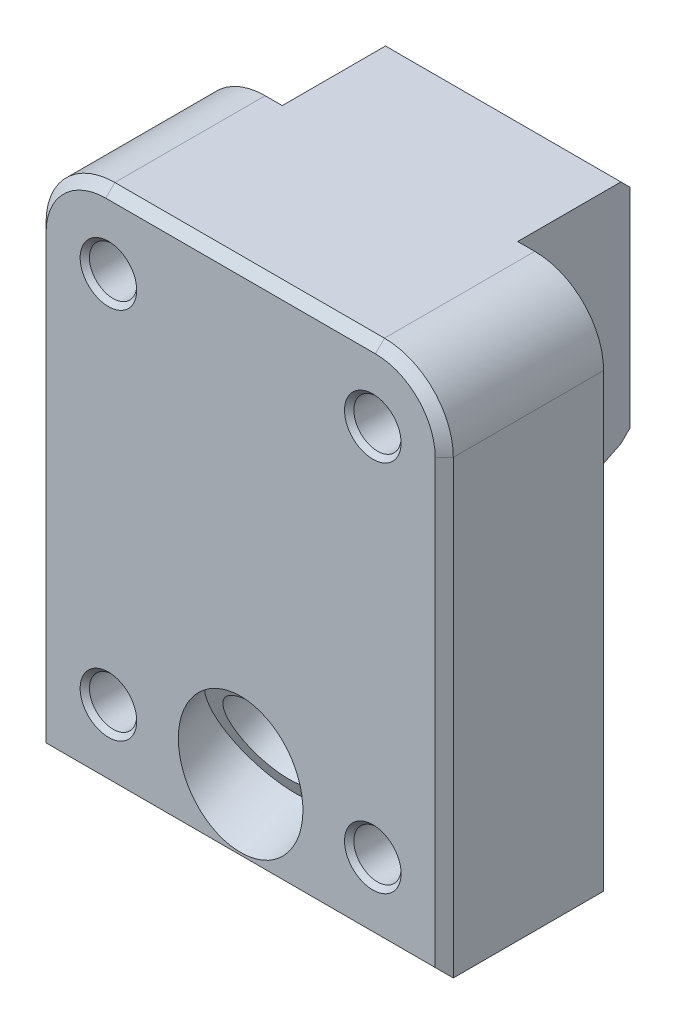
ISO-10303-21;
HEADER;
FILE_DESCRIPTION(('STEP AP214'),'2;1');
FILE_NAME('part.step','',(''),(''),'','','');
FILE_SCHEMA(('AUTOMOTIVE_DESIGN { 1 0 10303 214 1 1 1 1 }'));
ENDSEC;
DATA;
#1=APPLICATION_CONTEXT('core data for automotive mechanical design processes');
#2=APPLICATION_PROTOCOL_DEFINITION('international standard','automotive_design',2000,#1);
#3=PRODUCT_CONTEXT('',#1,'mechanical');
#4=PRODUCT('Part','Part','',(#3));
#5=PRODUCT_RELATED_PRODUCT_CATEGORY('part','',(#4));
#6=PRODUCT_DEFINITION_FORMATION('','',#4);
#7=PRODUCT_DEFINITION_CONTEXT('part definition',#1,'design');
#8=PRODUCT_DEFINITION('design','',#6,#7);
#9=PRODUCT_DEFINITION_SHAPE('','',#8);
#10=(LENGTH_UNIT() NAMED_UNIT(*) SI_UNIT(.MILLI.,.METRE.));
#11=(NAMED_UNIT(*) PLANE_ANGLE_UNIT() SI_UNIT($,.RADIAN.));
#12=(NAMED_UNIT(*) SI_UNIT($,.STERADIAN.) SOLID_ANGLE_UNIT());
#13=UNCERTAINTY_MEASURE_WITH_UNIT(LENGTH_MEASURE(1.E-05),#10,'distance_accuracy_value','');
#14=(GEOMETRIC_REPRESENTATION_CONTEXT(3) GLOBAL_UNCERTAINTY_ASSIGNED_CONTEXT((#13)) GLOBAL_UNIT_ASSIGNED_CONTEXT((#10,
#11,#12)) REPRESENTATION_CONTEXT('',''));
#15=CARTESIAN_POINT('',(0.,0.,0.));
#16=DIRECTION('',(0.,0.,1.));
#17=DIRECTION('',(1.,0.,0.));
#18=AXIS2_PLACEMENT_3D('',#15,#16,#17);
#19=CARTESIAN_POINT('',(0.,72.898,22.352));
#20=DIRECTION('',(0.,0.,-1.));
#21=DIRECTION('',(-1.,0.,0.));
#22=AXIS2_PLACEMENT_3D('',#19,#20,#21);
#23=PLANE('',#22);
#24=DIRECTION('',(0.999999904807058,-0.000436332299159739,0.));
#25=VECTOR('',#24,1.);
#26=CARTESIAN_POINT('',(-14.573250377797,62.6092683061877,22.352));
#27=LINE('',#26,#25);
#28=CARTESIAN_POINT('',(-14.5729963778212,62.6092681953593,22.352));
#29=VERTEX_POINT('',#28);
#30=CARTESIAN_POINT('',(-14.573250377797,62.6092683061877,22.352));
#31=VERTEX_POINT('',#30);
#32=EDGE_CURVE('E379',#29,#31,#27,.F.);
#33=ORIENTED_EDGE('',*,*,#32,.F.);
#34=CARTESIAN_POINT('',(-18.542,62.611,22.352));
#35=DIRECTION('',(0.,0.,1.));
#36=DIRECTION('',(1.,0.,0.));
#37=AXIS2_PLACEMENT_3D('',#34,#35,#36);
#38=CIRCLE('',#37,3.969004);
#39=CARTESIAN_POINT('',(-14.572996,62.611,22.352));
#40=VERTEX_POINT('',#39);
#41=EDGE_CURVE('E330',#40,#29,#38,.T.);
#42=ORIENTED_EDGE('',*,*,#41,.F.);
#43=DIRECTION('',(1.,0.,0.));
#44=VECTOR('',#43,1.);
#45=CARTESIAN_POINT('',(-14.57325,62.611,22.352));
#46=LINE('',#45,#44);
#47=CARTESIAN_POINT('',(-14.57325,62.611,22.352));
#48=VERTEX_POINT('',#47);
#49=EDGE_CURVE('E43',#40,#48,#46,.F.);
#50=ORIENTED_EDGE('',*,*,#49,.T.);
#51=CARTESIAN_POINT('',(-18.542,62.611,22.352));
#52=DIRECTION('',(0.,0.,-1.));
#53=DIRECTION('',(-1.,0.,0.));
#54=AXIS2_PLACEMENT_3D('',#51,#52,#53);
#55=CIRCLE('',#54,3.96875);
#56=EDGE_CURVE('E593',#48,#31,#55,.T.);
#57=ORIENTED_EDGE('',*,*,#56,.T.);
#58=EDGE_LOOP('',(#33,#42,#50,#57));
#59=FACE_BOUND('',#58,.T.);
#60=DIRECTION('',(0.999999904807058,-0.000436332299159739,0.));
#61=VECTOR('',#60,1.);
#62=CARTESIAN_POINT('',(22.510749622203,62.6092683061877,22.352));
#63=LINE('',#62,#61);
#64=CARTESIAN_POINT('',(22.5110036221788,62.6092681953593,22.352));
#65=VERTEX_POINT('',#64);
#66=CARTESIAN_POINT('',(22.510749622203,62.6092683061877,22.352));
#67=VERTEX_POINT('',#66);
#68=EDGE_CURVE('E615',#65,#67,#63,.F.);
#69=ORIENTED_EDGE('',*,*,#68,.F.);
#70=CARTESIAN_POINT('',(18.542,62.611,22.352));
#71=DIRECTION('',(0.,0.,1.));
#72=DIRECTION('',(1.,0.,0.));
#73=AXIS2_PLACEMENT_3D('',#70,#71,#72);
#74=CIRCLE('',#73,3.969004);
#75=CARTESIAN_POINT('',(22.511004,62.611,22.352));
#76=VERTEX_POINT('',#75);
#77=EDGE_CURVE('E1567',#76,#65,#74,.T.);
#78=ORIENTED_EDGE('',*,*,#77,.F.);
#79=DIRECTION('',(1.,0.,0.));
#80=VECTOR('',#79,1.);
#81=CARTESIAN_POINT('',(22.51075,62.611,22.352));
#82=LINE('',#81,#80);
#83=CARTESIAN_POINT('',(22.51075,62.611,22.352));
#84=VERTEX_POINT('',#83);
#85=EDGE_CURVE('E619',#76,#84,#82,.F.);
#86=ORIENTED_EDGE('',*,*,#85,.T.);
#87=CARTESIAN_POINT('',(18.542,62.611,22.352));
#88=DIRECTION('',(0.,0.,-1.));
#89=DIRECTION('',(-1.,0.,0.));
#90=AXIS2_PLACEMENT_3D('',#87,#88,#89);
#91=CIRCLE('',#90,3.96875);
#92=EDGE_CURVE('E386',#84,#67,#91,.T.);
#93=ORIENTED_EDGE('',*,*,#92,.T.);
#94=EDGE_LOOP('',(#69,#78,#86,#93));
#95=FACE_BOUND('',#94,.T.);
#96=DIRECTION('',(0.,-1.,0.));
#97=VECTOR('',#96,1.);
#98=CARTESIAN_POINT('',(-27.2923,0.,22.352));
#99=LINE('',#98,#97);
#100=CARTESIAN_POINT('',(-27.2923,63.246,22.352));
#101=VERTEX_POINT('',#100);
#102=CARTESIAN_POINT('',(-27.2923,1.27,22.352));
#103=VERTEX_POINT('',#102);
#104=EDGE_CURVE('E713',#101,#103,#99,.T.);
#105=ORIENTED_EDGE('',*,*,#104,.T.);
#106=DIRECTION('',(1.,0.,0.));
#107=VECTOR('',#106,1.);
#108=CARTESIAN_POINT('',(28.5623,1.27,22.352));
#109=LINE('',#108,#107);
#110=CARTESIAN_POINT('',(27.2923,1.27,22.352));
#111=VERTEX_POINT('',#110);
#112=EDGE_CURVE('E545',#103,#111,#109,.T.);
#113=ORIENTED_EDGE('',*,*,#112,.T.);
#114=DIRECTION('',(0.,1.,0.));
#115=VECTOR('',#114,1.);
#116=CARTESIAN_POINT('',(27.2923,72.898,22.352));
#117=LINE('',#116,#115);
#118=CARTESIAN_POINT('',(27.2923,63.246,22.352));
#119=VERTEX_POINT('',#118);
#120=EDGE_CURVE('E550',#111,#119,#117,.T.);
#121=ORIENTED_EDGE('',*,*,#120,.T.);
#122=CARTESIAN_POINT('',(18.9103,63.246,22.352));
#123=DIRECTION('',(0.,0.,-1.));
#124=DIRECTION('',(-1.,0.,0.));
#125=AXIS2_PLACEMENT_3D('',#122,#123,#124);
#126=CIRCLE('',#125,8.382);
#127=CARTESIAN_POINT('',(18.9103,71.628,22.352));
#128=VERTEX_POINT('',#127);
#129=EDGE_CURVE('E535',#119,#128,#126,.F.);
#130=ORIENTED_EDGE('',*,*,#129,.T.);
#131=DIRECTION('',(-1.,0.,0.));
#132=VECTOR('',#131,1.);
#133=CARTESIAN_POINT('',(0.,71.628,22.352));
#134=LINE('',#133,#132);
#135=CARTESIAN_POINT('',(-18.9103,71.628,22.352));
#136=VERTEX_POINT('',#135);
#137=EDGE_CURVE('E717',#128,#136,#134,.T.);
#138=ORIENTED_EDGE('',*,*,#137,.T.);
#139=CARTESIAN_POINT('',(-18.9103,63.246,22.352));
#140=DIRECTION('',(0.,0.,-1.));
#141=DIRECTION('',(-1.,0.,0.));
#142=AXIS2_PLACEMENT_3D('',#139,#140,#141);
#143=CIRCLE('',#142,8.382);
#144=EDGE_CURVE('E715',#136,#101,#143,.F.);
#145=ORIENTED_EDGE('',*,*,#144,.T.);
#146=EDGE_LOOP('',(#105,#113,#121,#130,#138,#145));
#147=FACE_BOUND('',#146,.T.);
#148=CARTESIAN_POINT('',(0.,11.0937104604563,22.352));
#149=DIRECTION('',(0.,0.,-1.));
#150=DIRECTION('',(0.,1.,0.));
#151=AXIS2_PLACEMENT_3D('',#148,#149,#150);
#152=ELLIPSE('',#151,9.49218243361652,8.7376);
#153=CARTESIAN_POINT('',(0.,20.5858928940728,22.352));
#154=VERTEX_POINT('',#153);
#155=EDGE_CURVE('E660',#154,#154,#152,.F.);
#156=ORIENTED_EDGE('',*,*,#155,.F.);
#157=EDGE_LOOP('',(#156));
#158=FACE_BOUND('',#157,.T.);
#159=DIRECTION('',(0.999999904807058,-0.000436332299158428,0.));
#160=VECTOR('',#159,1.);
#161=CARTESIAN_POINT('',(-14.573250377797,10.2852683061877,22.352));
#162=LINE('',#161,#160);
#163=CARTESIAN_POINT('',(-14.5729963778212,10.2852681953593,22.352));
#164=VERTEX_POINT('',#163);
#165=CARTESIAN_POINT('',(-14.573250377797,10.2852683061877,22.352));
#166=VERTEX_POINT('',#165);
#167=EDGE_CURVE('E1507',#164,#166,#162,.F.);
#168=ORIENTED_EDGE('',*,*,#167,.F.);
#169=CARTESIAN_POINT('',(-18.542,10.287,22.352));
#170=DIRECTION('',(0.,0.,1.));
#171=DIRECTION('',(1.,0.,0.));
#172=AXIS2_PLACEMENT_3D('',#169,#170,#171);
#173=CIRCLE('',#172,3.969004);
#174=CARTESIAN_POINT('',(-14.572996,10.287,22.352));
#175=VERTEX_POINT('',#174);
#176=EDGE_CURVE('E1472',#175,#164,#173,.T.);
#177=ORIENTED_EDGE('',*,*,#176,.F.);
#178=DIRECTION('',(1.,0.,0.));
#179=VECTOR('',#178,1.);
#180=CARTESIAN_POINT('',(-14.57325,10.287,22.352));
#181=LINE('',#180,#179);
#182=CARTESIAN_POINT('',(-14.57325,10.287,22.352));
#183=VERTEX_POINT('',#182);
#184=EDGE_CURVE('E1500',#175,#183,#181,.F.);
#185=ORIENTED_EDGE('',*,*,#184,.T.);
#186=CARTESIAN_POINT('',(-18.542,10.287,22.352));
#187=DIRECTION('',(0.,0.,-1.));
#188=DIRECTION('',(-1.,0.,0.));
#189=AXIS2_PLACEMENT_3D('',#186,#187,#188);
#190=CIRCLE('',#189,3.96875);
#191=EDGE_CURVE('E385',#183,#166,#190,.T.);
#192=ORIENTED_EDGE('',*,*,#191,.T.);
#193=EDGE_LOOP('',(#168,#177,#185,#192));
#194=FACE_BOUND('',#193,.T.);
#195=DIRECTION('',(0.999999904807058,-0.00043633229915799,0.));
#196=VECTOR('',#195,1.);
#197=CARTESIAN_POINT('',(22.510749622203,10.2852683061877,22.352));
#198=LINE('',#197,#196);
#199=CARTESIAN_POINT('',(22.5110036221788,10.2852681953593,22.352));
#200=VERTEX_POINT('',#199);
#201=CARTESIAN_POINT('',(22.510749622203,10.2852683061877,22.352));
#202=VERTEX_POINT('',#201);
#203=EDGE_CURVE('E352',#200,#202,#198,.F.);
#204=ORIENTED_EDGE('',*,*,#203,.F.);
#205=CARTESIAN_POINT('',(18.542,10.287,22.352));
#206=DIRECTION('',(0.,0.,1.));
#207=DIRECTION('',(1.,0.,0.));
#208=AXIS2_PLACEMENT_3D('',#205,#206,#207);
#209=CIRCLE('',#208,3.969004);
#210=CARTESIAN_POINT('',(22.511004,10.287,22.352));
#211=VERTEX_POINT('',#210);
#212=EDGE_CURVE('E414',#211,#200,#209,.T.);
#213=ORIENTED_EDGE('',*,*,#212,.F.);
#214=DIRECTION('',(1.,0.,0.));
#215=VECTOR('',#214,1.);
#216=CARTESIAN_POINT('',(22.51075,10.287,22.352));
#217=LINE('',#216,#215);
#218=CARTESIAN_POINT('',(22.51075,10.287,22.352));
#219=VERTEX_POINT('',#218);
#220=EDGE_CURVE('E22',#211,#219,#217,.F.);
#221=ORIENTED_EDGE('',*,*,#220,.T.);
#222=CARTESIAN_POINT('',(18.542,10.287,22.352));
#223=DIRECTION('',(0.,0.,-1.));
#224=DIRECTION('',(-1.,0.,0.));
#225=AXIS2_PLACEMENT_3D('',#222,#223,#224);
#226=CIRCLE('',#225,3.96875);
#227=EDGE_CURVE('E382',#219,#202,#226,.T.);
#228=ORIENTED_EDGE('',*,*,#227,.T.);
#229=EDGE_LOOP('',(#204,#213,#221,#228));
#230=FACE_BOUND('',#229,.T.);
#231=ADVANCED_FACE('F18',(#59,#95,#147,#158,#194,#230),#23,.F.);
#232=CARTESIAN_POINT('',(-16.51,72.898,0.));
#233=DIRECTION('',(-1.,0.,0.));
#234=DIRECTION('',(0.,0.,1.));
#235=AXIS2_PLACEMENT_3D('',#232,#233,#234);
#236=PLANE('',#235);
#237=DIRECTION('',(0.,-1.,0.));
#238=VECTOR('',#237,1.);
#239=CARTESIAN_POINT('',(-16.51,72.898,-15.748));
#240=LINE('',#239,#238);
#241=CARTESIAN_POINT('',(-16.51,71.628,-15.748));
#242=VERTEX_POINT('',#241);
#243=CARTESIAN_POINT('',(-16.51,42.3653663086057,-15.748));
#244=VERTEX_POINT('',#243);
#245=EDGE_CURVE('E673',#242,#244,#240,.T.);
#246=ORIENTED_EDGE('',*,*,#245,.T.);
#247=DIRECTION('',(0.,0.707106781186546,-0.707106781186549));
#248=VECTOR('',#247,1.);
#249=CARTESIAN_POINT('',(-16.51,49.7576831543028,-23.1403168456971));
#250=LINE('',#249,#248);
#251=CARTESIAN_POINT('',(-16.51,41.1009876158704,-14.4836213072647));
#252=VERTEX_POINT('',#251);
#253=EDGE_CURVE('E571',#244,#252,#250,.F.);
#254=ORIENTED_EDGE('',*,*,#253,.T.);
#255=DIRECTION('',(0.,0.438371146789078,-0.898794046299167));
#256=VECTOR('',#255,1.);
#257=CARTESIAN_POINT('',(-16.51,41.5047713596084,-15.3115006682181));
#258=LINE('',#257,#256);
#259=CARTESIAN_POINT('',(-16.51,34.7326222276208,-1.42653728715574));
#260=VERTEX_POINT('',#259);
#261=EDGE_CURVE('E659',#260,#252,#258,.T.);
#262=ORIENTED_EDGE('',*,*,#261,.F.);
#263=CARTESIAN_POINT('',(-16.51,32.4496853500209,-2.54));
#264=DIRECTION('',(-1.,0.,0.));
#265=DIRECTION('',(0.,0.,1.));
#266=AXIS2_PLACEMENT_3D('',#263,#264,#265);
#267=CIRCLE('',#266,2.54);
#268=CARTESIAN_POINT('',(-16.51,32.4496853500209,0.));
#269=VERTEX_POINT('',#268);
#270=EDGE_CURVE('E585',#260,#269,#267,.F.);
#271=ORIENTED_EDGE('',*,*,#270,.T.);
#272=DIRECTION('',(0.,-1.,0.));
#273=VECTOR('',#272,1.);
#274=CARTESIAN_POINT('',(-16.51,72.898,0.));
#275=LINE('',#274,#273);
#276=CARTESIAN_POINT('',(-16.51,72.898,0.));
#277=VERTEX_POINT('',#276);
#278=EDGE_CURVE('E671',#277,#269,#275,.T.);
#279=ORIENTED_EDGE('',*,*,#278,.F.);
#280=DIRECTION('',(0.,0.,1.));
#281=VECTOR('',#280,1.);
#282=CARTESIAN_POINT('',(-16.51,72.898,0.));
#283=LINE('',#282,#281);
#284=CARTESIAN_POINT('',(-16.51,72.898,-14.478));
#285=VERTEX_POINT('',#284);
#286=EDGE_CURVE('E684',#285,#277,#283,.T.);
#287=ORIENTED_EDGE('',*,*,#286,.F.);
#288=DIRECTION('',(0.,0.707106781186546,0.70710678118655));
#289=VECTOR('',#288,1.);
#290=CARTESIAN_POINT('',(-16.51,80.137,-7.239));
#291=LINE('',#290,#289);
#292=EDGE_CURVE('E562',#285,#242,#291,.F.);
#293=ORIENTED_EDGE('',*,*,#292,.T.);
#294=EDGE_LOOP('',(#246,#254,#262,#271,#279,#287,#293));
#295=FACE_BOUND('',#294,.T.);
#296=ADVANCED_FACE('F451',(#295),#236,.T.);
#297=CARTESIAN_POINT('',(16.51,72.898,0.));
#298=DIRECTION('',(-1.,0.,0.));
#299=DIRECTION('',(0.,0.,1.));
#300=AXIS2_PLACEMENT_3D('',#297,#298,#299);
#301=PLANE('',#300);
#302=DIRECTION('',(0.,-1.,0.));
#303=VECTOR('',#302,1.);
#304=CARTESIAN_POINT('',(16.51,72.898,0.));
#305=LINE('',#304,#303);
#306=CARTESIAN_POINT('',(16.51,72.898,0.));
#307=VERTEX_POINT('',#306);
#308=CARTESIAN_POINT('',(16.51,32.4496853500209,0.));
#309=VERTEX_POINT('',#308);
#310=EDGE_CURVE('E679',#307,#309,#305,.T.);
#311=ORIENTED_EDGE('',*,*,#310,.T.);
#312=CARTESIAN_POINT('',(16.51,32.4496853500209,-2.54));
#313=DIRECTION('',(-1.,0.,0.));
#314=DIRECTION('',(0.,0.,1.));
#315=AXIS2_PLACEMENT_3D('',#312,#313,#314);
#316=CIRCLE('',#315,2.54);
#317=CARTESIAN_POINT('',(16.51,34.7326222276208,-1.42653728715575));
#318=VERTEX_POINT('',#317);
#319=EDGE_CURVE('E588',#309,#318,#316,.T.);
#320=ORIENTED_EDGE('',*,*,#319,.T.);
#321=DIRECTION('',(0.,0.438371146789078,-0.898794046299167));
#322=VECTOR('',#321,1.);
#323=CARTESIAN_POINT('',(16.51,41.5047713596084,-15.3115006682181));
#324=LINE('',#323,#322);
#325=CARTESIAN_POINT('',(16.51,41.1009876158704,-14.4836213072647));
#326=VERTEX_POINT('',#325);
#327=EDGE_CURVE('E657',#318,#326,#324,.T.);
#328=ORIENTED_EDGE('',*,*,#327,.T.);
#329=DIRECTION('',(0.,-0.707106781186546,0.707106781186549));
#330=VECTOR('',#329,1.);
#331=CARTESIAN_POINT('',(16.51,42.3653663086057,-15.748));
#332=LINE('',#331,#330);
#333=CARTESIAN_POINT('',(16.51,42.3653663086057,-15.748));
#334=VERTEX_POINT('',#333);
#335=EDGE_CURVE('E577',#326,#334,#332,.F.);
#336=ORIENTED_EDGE('',*,*,#335,.T.);
#337=DIRECTION('',(0.,-1.,0.));
#338=VECTOR('',#337,1.);
#339=CARTESIAN_POINT('',(16.51,72.898,-15.748));
#340=LINE('',#339,#338);
#341=CARTESIAN_POINT('',(16.51,71.628,-15.748));
#342=VERTEX_POINT('',#341);
#343=EDGE_CURVE('E676',#342,#334,#340,.T.);
#344=ORIENTED_EDGE('',*,*,#343,.F.);
#345=DIRECTION('',(0.,-0.707106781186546,-0.70710678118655));
#346=VECTOR('',#345,1.);
#347=CARTESIAN_POINT('',(16.51,72.898,-14.478));
#348=LINE('',#347,#346);
#349=CARTESIAN_POINT('',(16.51,72.898,-14.478));
#350=VERTEX_POINT('',#349);
#351=EDGE_CURVE('E566',#342,#350,#348,.F.);
#352=ORIENTED_EDGE('',*,*,#351,.T.);
#353=DIRECTION('',(0.,0.,1.));
#354=VECTOR('',#353,1.);
#355=CARTESIAN_POINT('',(16.51,72.898,0.));
#356=LINE('',#355,#354);
#357=EDGE_CURVE('E656',#350,#307,#356,.T.);
#358=ORIENTED_EDGE('',*,*,#357,.T.);
#359=EDGE_LOOP('',(#311,#320,#328,#336,#344,#352,#358));
#360=FACE_BOUND('',#359,.T.);
#361=ADVANCED_FACE('F457',(#360),#301,.F.);
#362=CARTESIAN_POINT('',(16.51,72.898,-15.748));
#363=DIRECTION('',(0.,0.,1.));
#364=DIRECTION('',(1.,0.,0.));
#365=AXIS2_PLACEMENT_3D('',#362,#363,#364);
#366=PLANE('',#365);
#367=ORIENTED_EDGE('',*,*,#343,.T.);
#368=DIRECTION('',(-1.,0.,0.));
#369=VECTOR('',#368,1.);
#370=CARTESIAN_POINT('',(16.51,42.3653663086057,-15.748));
#371=LINE('',#370,#369);
#372=EDGE_CURVE('E568',#334,#244,#371,.T.);
#373=ORIENTED_EDGE('',*,*,#372,.T.);
#374=ORIENTED_EDGE('',*,*,#245,.F.);
#375=DIRECTION('',(1.,0.,0.));
#376=VECTOR('',#375,1.);
#377=CARTESIAN_POINT('',(16.51,71.628,-15.748));
#378=LINE('',#377,#376);
#379=EDGE_CURVE('E564',#242,#342,#378,.T.);
#380=ORIENTED_EDGE('',*,*,#379,.T.);
#381=EDGE_LOOP('',(#367,#373,#374,#380));
#382=FACE_BOUND('',#381,.T.);
#383=ADVANCED_FACE('F474',(#382),#366,.F.);
#384=CARTESIAN_POINT('',(-16.51,72.898,22.352));
#385=DIRECTION('',(0.,-1.,0.));
#386=DIRECTION('',(0.,0.,-1.));
#387=AXIS2_PLACEMENT_3D('',#384,#385,#386);
#388=PLANE('',#387);
#389=ORIENTED_EDGE('',*,*,#357,.F.);
#390=DIRECTION('',(-1.,0.,0.));
#391=VECTOR('',#390,1.);
#392=CARTESIAN_POINT('',(-16.51,72.898,-14.478));
#393=LINE('',#392,#391);
#394=EDGE_CURVE('E559',#350,#285,#393,.T.);
#395=ORIENTED_EDGE('',*,*,#394,.T.);
#396=ORIENTED_EDGE('',*,*,#286,.T.);
#397=DIRECTION('',(-1.,0.,0.));
#398=VECTOR('',#397,1.);
#399=CARTESIAN_POINT('',(28.5623,72.898,0.));
#400=LINE('',#399,#398);
#401=CARTESIAN_POINT('',(-18.9103,72.898,0.));
#402=VERTEX_POINT('',#401);
#403=EDGE_CURVE('E667',#277,#402,#400,.T.);
#404=ORIENTED_EDGE('',*,*,#403,.T.);
#405=DIRECTION('',(0.,0.,1.));
#406=VECTOR('',#405,1.);
#407=CARTESIAN_POINT('',(-18.9103,72.898,22.352));
#408=LINE('',#407,#406);
#409=CARTESIAN_POINT('',(-18.9103,72.898,21.082));
#410=VERTEX_POINT('',#409);
#411=EDGE_CURVE('E524',#402,#410,#408,.T.);
#412=ORIENTED_EDGE('',*,*,#411,.T.);
#413=DIRECTION('',(1.,0.,0.));
#414=VECTOR('',#413,1.);
#415=CARTESIAN_POINT('',(-16.51,72.898,21.082));
#416=LINE('',#415,#414);
#417=CARTESIAN_POINT('',(18.9103,72.898,21.082));
#418=VERTEX_POINT('',#417);
#419=EDGE_CURVE('E547',#410,#418,#416,.T.);
#420=ORIENTED_EDGE('',*,*,#419,.T.);
#421=DIRECTION('',(0.,0.,1.));
#422=VECTOR('',#421,1.);
#423=CARTESIAN_POINT('',(18.9103,72.898,22.352));
#424=LINE('',#423,#422);
#425=CARTESIAN_POINT('',(18.9103,72.898,0.));
#426=VERTEX_POINT('',#425);
#427=EDGE_CURVE('E702',#418,#426,#424,.F.);
#428=ORIENTED_EDGE('',*,*,#427,.T.);
#429=EDGE_CURVE('E670',#426,#307,#400,.T.);
#430=ORIENTED_EDGE('',*,*,#429,.T.);
#431=EDGE_LOOP('',(#389,#395,#396,#404,#412,#420,#428,#430));
#432=FACE_BOUND('',#431,.T.);
#433=ADVANCED_FACE('F464',(#432),#388,.F.);
#434=CARTESIAN_POINT('',(-16.51,0.,22.352));
#435=DIRECTION('',(0.,-1.,0.));
#436=DIRECTION('',(0.,0.,-1.));
#437=AXIS2_PLACEMENT_3D('',#434,#435,#436);
#438=PLANE('',#437);
#439=DIRECTION('',(0.,0.,-1.));
#440=VECTOR('',#439,1.);
#441=CARTESIAN_POINT('',(28.5623,0.,22.352));
#442=LINE('',#441,#440);
#443=CARTESIAN_POINT('',(28.5623,0.,21.082));
#444=VERTEX_POINT('',#443);
#445=CARTESIAN_POINT('',(28.5623,0.,0.));
#446=VERTEX_POINT('',#445);
#447=EDGE_CURVE('E666',#444,#446,#442,.T.);
#448=ORIENTED_EDGE('',*,*,#447,.F.);
#449=DIRECTION('',(-1.,0.,0.));
#450=VECTOR('',#449,1.);
#451=CARTESIAN_POINT('',(-28.5623,0.,21.082));
#452=LINE('',#451,#450);
#453=CARTESIAN_POINT('',(-28.5623,0.,21.082));
#454=VERTEX_POINT('',#453);
#455=EDGE_CURVE('E710',#444,#454,#452,.T.);
#456=ORIENTED_EDGE('',*,*,#455,.T.);
#457=DIRECTION('',(0.,0.,-1.));
#458=VECTOR('',#457,1.);
#459=CARTESIAN_POINT('',(-28.5623,0.,22.352));
#460=LINE('',#459,#458);
#461=CARTESIAN_POINT('',(-28.5623,0.,0.));
#462=VERTEX_POINT('',#461);
#463=EDGE_CURVE('E662',#454,#462,#460,.T.);
#464=ORIENTED_EDGE('',*,*,#463,.T.);
#465=DIRECTION('',(-1.,0.,0.));
#466=VECTOR('',#465,1.);
#467=CARTESIAN_POINT('',(28.5623,0.,0.));
#468=LINE('',#467,#466);
#469=EDGE_CURVE('E663',#446,#462,#468,.T.);
#470=ORIENTED_EDGE('',*,*,#469,.F.);
#471=EDGE_LOOP('',(#448,#456,#464,#470));
#472=FACE_BOUND('',#471,.T.);
#473=ADVANCED_FACE('F502',(#472),#438,.T.);
#474=CARTESIAN_POINT('',(-28.5623,72.898,22.352));
#475=DIRECTION('',(-1.,0.,0.));
#476=DIRECTION('',(0.,0.,1.));
#477=AXIS2_PLACEMENT_3D('',#474,#475,#476);
#478=PLANE('',#477);
#479=ORIENTED_EDGE('',*,*,#463,.F.);
#480=DIRECTION('',(0.,1.,0.));
#481=VECTOR('',#480,1.);
#482=CARTESIAN_POINT('',(-28.5623,63.246,21.082));
#483=LINE('',#482,#481);
#484=CARTESIAN_POINT('',(-28.5623,63.246,21.082));
#485=VERTEX_POINT('',#484);
#486=EDGE_CURVE('E557',#454,#485,#483,.T.);
#487=ORIENTED_EDGE('',*,*,#486,.T.);
#488=DIRECTION('',(0.,0.,1.));
#489=VECTOR('',#488,1.);
#490=CARTESIAN_POINT('',(-28.5623,63.246,0.));
#491=LINE('',#490,#489);
#492=CARTESIAN_POINT('',(-28.5623,63.246,0.));
#493=VERTEX_POINT('',#492);
#494=EDGE_CURVE('E708',#485,#493,#491,.F.);
#495=ORIENTED_EDGE('',*,*,#494,.T.);
#496=DIRECTION('',(0.,-1.,0.));
#497=VECTOR('',#496,1.);
#498=CARTESIAN_POINT('',(-28.5623,72.898,0.));
#499=LINE('',#498,#497);
#500=EDGE_CURVE('E525',#493,#462,#499,.T.);
#501=ORIENTED_EDGE('',*,*,#500,.T.);
#502=EDGE_LOOP('',(#479,#487,#495,#501));
#503=FACE_BOUND('',#502,.T.);
#504=ADVANCED_FACE('F470',(#503),#478,.T.);
#505=CARTESIAN_POINT('',(28.5623,72.898,0.));
#506=DIRECTION('',(0.,0.,1.));
#507=DIRECTION('',(1.,0.,0.));
#508=AXIS2_PLACEMENT_3D('',#505,#506,#507);
#509=PLANE('',#508);
#510=ORIENTED_EDGE('',*,*,#278,.T.);
#511=DIRECTION('',(-1.,0.,0.));
#512=VECTOR('',#511,1.);
#513=CARTESIAN_POINT('',(16.51,32.4496853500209,0.));
#514=LINE('',#513,#512);
#515=EDGE_CURVE('E582',#269,#309,#514,.F.);
#516=ORIENTED_EDGE('',*,*,#515,.T.);
#517=ORIENTED_EDGE('',*,*,#310,.F.);
#518=ORIENTED_EDGE('',*,*,#429,.F.);
#519=CARTESIAN_POINT('',(18.9103,63.246,0.));
#520=DIRECTION('',(0.,0.,1.));
#521=DIRECTION('',(1.,0.,0.));
#522=AXIS2_PLACEMENT_3D('',#519,#520,#521);
#523=CIRCLE('',#522,9.652);
#524=CARTESIAN_POINT('',(28.5623,63.246,0.));
#525=VERTEX_POINT('',#524);
#526=EDGE_CURVE('E706',#426,#525,#523,.F.);
#527=ORIENTED_EDGE('',*,*,#526,.T.);
#528=DIRECTION('',(0.,-1.,0.));
#529=VECTOR('',#528,1.);
#530=CARTESIAN_POINT('',(28.5623,72.898,0.));
#531=LINE('',#530,#529);
#532=EDGE_CURVE('E521',#525,#446,#531,.T.);
#533=ORIENTED_EDGE('',*,*,#532,.T.);
#534=ORIENTED_EDGE('',*,*,#469,.T.);
#535=ORIENTED_EDGE('',*,*,#500,.F.);
#536=CARTESIAN_POINT('',(-18.9103,63.246,0.));
#537=DIRECTION('',(0.,0.,1.));
#538=DIRECTION('',(1.,0.,0.));
#539=AXIS2_PLACEMENT_3D('',#536,#537,#538);
#540=CIRCLE('',#539,9.652);
#541=EDGE_CURVE('E704',#493,#402,#540,.F.);
#542=ORIENTED_EDGE('',*,*,#541,.T.);
#543=ORIENTED_EDGE('',*,*,#403,.F.);
#544=EDGE_LOOP('',(#510,#516,#517,#518,#527,#533,#534,#535,#542,#543));
#545=FACE_BOUND('',#544,.T.);
#546=CARTESIAN_POINT('',(0.,20.5815715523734,0.));
#547=DIRECTION('',(0.,0.,1.));
#548=DIRECTION('',(0.,-1.,0.));
#549=AXIS2_PLACEMENT_3D('',#546,#547,#548);
#550=ELLIPSE('',#549,6.90528678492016,6.35635);
#551=CARTESIAN_POINT('',(0.,13.6762847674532,0.));
#552=VERTEX_POINT('',#551);
#553=EDGE_CURVE('E690',#552,#552,#550,.T.);
#554=ORIENTED_EDGE('',*,*,#553,.T.);
#555=EDGE_LOOP('',(#554));
#556=FACE_BOUND('',#555,.T.);
#557=ADVANCED_FACE('F466',(#545,#556),#509,.F.);
#558=CARTESIAN_POINT('',(28.5623,72.898,22.352));
#559=DIRECTION('',(-1.,0.,0.));
#560=DIRECTION('',(0.,0.,1.));
#561=AXIS2_PLACEMENT_3D('',#558,#559,#560);
#562=PLANE('',#561);
#563=DIRECTION('',(0.,0.,1.));
#564=VECTOR('',#563,1.);
#565=CARTESIAN_POINT('',(28.5623,63.246,22.352));
#566=LINE('',#565,#564);
#567=CARTESIAN_POINT('',(28.5623,63.246,21.082));
#568=VERTEX_POINT('',#567);
#569=EDGE_CURVE('E515',#525,#568,#566,.T.);
#570=ORIENTED_EDGE('',*,*,#569,.T.);
#571=DIRECTION('',(0.,-1.,0.));
#572=VECTOR('',#571,1.);
#573=CARTESIAN_POINT('',(28.5623,72.898,21.082));
#574=LINE('',#573,#572);
#575=EDGE_CURVE('E518',#568,#444,#574,.T.);
#576=ORIENTED_EDGE('',*,*,#575,.T.);
#577=ORIENTED_EDGE('',*,*,#447,.T.);
#578=ORIENTED_EDGE('',*,*,#532,.F.);
#579=EDGE_LOOP('',(#570,#576,#577,#578));
#580=FACE_BOUND('',#579,.T.);
#581=ADVANCED_FACE('F469',(#580),#562,.F.);
#582=CARTESIAN_POINT('',(179.112288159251,34.0368535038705,0.));
#583=DIRECTION('',(0.,0.898794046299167,0.438371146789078));
#584=DIRECTION('',(0.,-0.438371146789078,0.898794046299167));
#585=AXIS2_PLACEMENT_3D('',#582,#583,#584);
#586=PLANE('',#585);
#587=ORIENTED_EDGE('',*,*,#327,.F.);
#588=DIRECTION('',(-1.,0.,0.));
#589=VECTOR('',#588,1.);
#590=CARTESIAN_POINT('',(-16.51,34.7326222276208,-1.42653728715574));
#591=LINE('',#590,#589);
#592=EDGE_CURVE('E579',#318,#260,#591,.T.);
#593=ORIENTED_EDGE('',*,*,#592,.T.);
#594=ORIENTED_EDGE('',*,*,#261,.T.);
#595=DIRECTION('',(1.,0.,0.));
#596=VECTOR('',#595,1.);
#597=CARTESIAN_POINT('',(179.112288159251,41.1009876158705,-14.4836213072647));
#598=LINE('',#597,#596);
#599=EDGE_CURVE('E574',#252,#326,#598,.T.);
#600=ORIENTED_EDGE('',*,*,#599,.T.);
#601=EDGE_LOOP('',(#587,#593,#594,#600));
#602=FACE_BOUND('',#601,.T.);
#603=ADVANCED_FACE('F505',(#602),#586,.F.);
#604=CARTESIAN_POINT('',(0.,2.48561801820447,42.6313949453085));
#605=DIRECTION('',(0.,0.390731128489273,-0.92050485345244));
#606=DIRECTION('',(0.,0.92050485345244,0.390731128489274));
#607=AXIS2_PLACEMENT_3D('',#604,#605,#606);
#608=CYLINDRICAL_SURFACE('',#607,8.7376);
#609=CARTESIAN_POINT('',(0.,12.9307820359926,18.0241305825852));
#610=DIRECTION('',(0.,-0.390731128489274,0.920504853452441));
#611=DIRECTION('',(0.,-0.92050485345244,-0.390731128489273));
#612=AXIS2_PLACEMENT_3D('',#609,#610,#611);
#613=CIRCLE('',#612,8.7376);
#614=CARTESIAN_POINT('',(0.,4.88777882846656,14.6100782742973));
#615=VERTEX_POINT('',#614);
#616=EDGE_CURVE('E683',#615,#615,#613,.T.);
#617=ORIENTED_EDGE('',*,*,#616,.F.);
#618=EDGE_LOOP('',(#617));
#619=FACE_BOUND('',#618,.T.);
#620=ORIENTED_EDGE('',*,*,#155,.T.);
#621=EDGE_LOOP('',(#620));
#622=FACE_BOUND('',#621,.T.);
#623=ADVANCED_FACE('F482',(#619,#622),#608,.F.);
#624=CARTESIAN_POINT('',(0.,12.9307820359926,18.0241305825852));
#625=DIRECTION('',(0.,-0.390731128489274,0.920504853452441));
#626=DIRECTION('',(0.,-0.92050485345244,-0.390731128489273));
#627=AXIS2_PLACEMENT_3D('',#624,#625,#626);
#628=PLANE('',#627);
#629=CARTESIAN_POINT('',(0.,12.9307820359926,18.0241305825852));
#630=DIRECTION('',(0.,-0.390731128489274,0.920504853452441));
#631=DIRECTION('',(0.,-0.92050485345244,-0.390731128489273));
#632=AXIS2_PLACEMENT_3D('',#629,#630,#631);
#633=CIRCLE('',#632,6.35635);
#634=CARTESIAN_POINT('',(0.,7.07973101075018,15.5405067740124));
#635=VERTEX_POINT('',#634);
#636=EDGE_CURVE('E686',#635,#635,#633,.T.);
#637=ORIENTED_EDGE('',*,*,#636,.F.);
#638=EDGE_LOOP('',(#637));
#639=FACE_BOUND('',#638,.T.);
#640=ORIENTED_EDGE('',*,*,#616,.T.);
#641=EDGE_LOOP('',(#640));
#642=FACE_BOUND('',#641,.T.);
#643=ADVANCED_FACE('F479',(#639,#642),#628,.T.);
#644=CARTESIAN_POINT('',(0.,22.3347593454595,-4.13025161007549));
#645=DIRECTION('',(0.,-0.390731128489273,0.92050485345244));
#646=DIRECTION('',(0.,-0.92050485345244,-0.390731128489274));
#647=AXIS2_PLACEMENT_3D('',#644,#645,#646);
#648=CYLINDRICAL_SURFACE('',#647,6.35635);
#649=ORIENTED_EDGE('',*,*,#636,.T.);
#650=EDGE_LOOP('',(#649));
#651=FACE_BOUND('',#650,.T.);
#652=ORIENTED_EDGE('',*,*,#553,.F.);
#653=EDGE_LOOP('',(#652));
#654=FACE_BOUND('',#653,.T.);
#655=ADVANCED_FACE('F20',(#651,#654),#648,.F.);
#656=CARTESIAN_POINT('',(-18.542,10.287,7.112));
#657=DIRECTION('',(0.,0.,1.));
#658=DIRECTION('',(1.,0.,0.));
#659=AXIS2_PLACEMENT_3D('',#656,#657,#658);
#660=CYLINDRICAL_SURFACE('',#659,3.3147);
#661=CARTESIAN_POINT('',(-18.542,10.287,21.69795));
#662=DIRECTION('',(0.,0.,-1.));
#663=DIRECTION('',(-1.,0.,0.));
#664=AXIS2_PLACEMENT_3D('',#661,#662,#663);
#665=CIRCLE('',#664,3.3147);
#666=CARTESIAN_POINT('',(-21.8567,10.287,21.69795));
#667=VERTEX_POINT('',#666);
#668=EDGE_CURVE('E590',#667,#667,#665,.F.);
#669=ORIENTED_EDGE('',*,*,#668,.T.);
#670=EDGE_LOOP('',(#669));
#671=FACE_BOUND('',#670,.T.);
#672=CARTESIAN_POINT('',(-18.542,10.287,5.207));
#673=DIRECTION('',(0.,0.,-1.));
#674=DIRECTION('',(-1.,0.,0.));
#675=AXIS2_PLACEMENT_3D('',#672,#673,#674);
#676=CIRCLE('',#675,3.3147);
#677=CARTESIAN_POINT('',(-21.8567,10.287,5.207));
#678=VERTEX_POINT('',#677);
#679=EDGE_CURVE('E638',#678,#678,#676,.T.);
#680=ORIENTED_EDGE('',*,*,#679,.T.);
#681=EDGE_LOOP('',(#680));
#682=FACE_BOUND('',#681,.T.);
#683=ADVANCED_FACE('F488',(#671,#682),#660,.F.);
#684=CARTESIAN_POINT('',(-18.542,62.611,7.112));
#685=DIRECTION('',(0.,0.,1.));
#686=DIRECTION('',(1.,0.,0.));
#687=AXIS2_PLACEMENT_3D('',#684,#685,#686);
#688=CYLINDRICAL_SURFACE('',#687,3.3147);
#689=CARTESIAN_POINT('',(-18.542,62.611,21.69795));
#690=DIRECTION('',(0.,0.,-1.));
#691=DIRECTION('',(-1.,0.,0.));
#692=AXIS2_PLACEMENT_3D('',#689,#690,#691);
#693=CIRCLE('',#692,3.3147);
#694=CARTESIAN_POINT('',(-21.8567,62.611,21.69795));
#695=VERTEX_POINT('',#694);
#696=EDGE_CURVE('E11',#695,#695,#693,.F.);
#697=ORIENTED_EDGE('',*,*,#696,.T.);
#698=EDGE_LOOP('',(#697));
#699=FACE_BOUND('',#698,.T.);
#700=CARTESIAN_POINT('',(-18.542,62.611,5.207));
#701=DIRECTION('',(0.,0.,-1.));
#702=DIRECTION('',(-1.,0.,0.));
#703=AXIS2_PLACEMENT_3D('',#700,#701,#702);
#704=CIRCLE('',#703,3.3147);
#705=CARTESIAN_POINT('',(-21.8567,62.611,5.207));
#706=VERTEX_POINT('',#705);
#707=EDGE_CURVE('E644',#706,#706,#704,.T.);
#708=ORIENTED_EDGE('',*,*,#707,.T.);
#709=EDGE_LOOP('',(#708));
#710=FACE_BOUND('',#709,.T.);
#711=ADVANCED_FACE('F484',(#699,#710),#688,.F.);
#712=CARTESIAN_POINT('',(18.542,62.611,7.112));
#713=DIRECTION('',(0.,0.,1.));
#714=DIRECTION('',(1.,0.,0.));
#715=AXIS2_PLACEMENT_3D('',#712,#713,#714);
#716=CYLINDRICAL_SURFACE('',#715,3.3147);
#717=CARTESIAN_POINT('',(18.542,62.611,21.69795));
#718=DIRECTION('',(0.,0.,-1.));
#719=DIRECTION('',(-1.,0.,0.));
#720=AXIS2_PLACEMENT_3D('',#717,#718,#719);
#721=CIRCLE('',#720,3.3147);
#722=CARTESIAN_POINT('',(15.2273,62.611,21.69795));
#723=VERTEX_POINT('',#722);
#724=EDGE_CURVE('E28',#723,#723,#721,.F.);
#725=ORIENTED_EDGE('',*,*,#724,.T.);
#726=EDGE_LOOP('',(#725));
#727=FACE_BOUND('',#726,.T.);
#728=CARTESIAN_POINT('',(18.542,62.611,5.207));
#729=DIRECTION('',(0.,0.,-1.));
#730=DIRECTION('',(-1.,0.,0.));
#731=AXIS2_PLACEMENT_3D('',#728,#729,#730);
#732=CIRCLE('',#731,3.3147);
#733=CARTESIAN_POINT('',(15.2273,62.611,5.207));
#734=VERTEX_POINT('',#733);
#735=EDGE_CURVE('E641',#734,#734,#732,.T.);
#736=ORIENTED_EDGE('',*,*,#735,.T.);
#737=EDGE_LOOP('',(#736));
#738=FACE_BOUND('',#737,.T.);
#739=ADVANCED_FACE('F487',(#727,#738),#716,.F.);
#740=CARTESIAN_POINT('',(18.542,10.287,7.112));
#741=DIRECTION('',(0.,0.,1.));
#742=DIRECTION('',(1.,0.,0.));
#743=AXIS2_PLACEMENT_3D('',#740,#741,#742);
#744=CYLINDRICAL_SURFACE('',#743,3.3147);
#745=CARTESIAN_POINT('',(18.542,10.287,21.69795));
#746=DIRECTION('',(0.,0.,-1.));
#747=DIRECTION('',(-1.,0.,0.));
#748=AXIS2_PLACEMENT_3D('',#745,#746,#747);
#749=CIRCLE('',#748,3.3147);
#750=CARTESIAN_POINT('',(15.2273,10.287,21.69795));
#751=VERTEX_POINT('',#750);
#752=EDGE_CURVE('E594',#751,#751,#749,.F.);
#753=ORIENTED_EDGE('',*,*,#752,.T.);
#754=EDGE_LOOP('',(#753));
#755=FACE_BOUND('',#754,.T.);
#756=CARTESIAN_POINT('',(18.542,10.287,5.207));
#757=DIRECTION('',(0.,0.,-1.));
#758=DIRECTION('',(-1.,0.,0.));
#759=AXIS2_PLACEMENT_3D('',#756,#757,#758);
#760=CIRCLE('',#759,3.3147);
#761=CARTESIAN_POINT('',(15.2273,10.287,5.207));
#762=VERTEX_POINT('',#761);
#763=EDGE_CURVE('E618',#762,#762,#760,.T.);
#764=ORIENTED_EDGE('',*,*,#763,.T.);
#765=EDGE_LOOP('',(#764));
#766=FACE_BOUND('',#765,.T.);
#767=ADVANCED_FACE('F492',(#755,#766),#744,.F.);
#768=CARTESIAN_POINT('',(18.9103,63.246,22.352));
#769=DIRECTION('',(0.,0.,1.));
#770=DIRECTION('',(1.,0.,0.));
#771=AXIS2_PLACEMENT_3D('',#768,#769,#770);
#772=CYLINDRICAL_SURFACE('',#771,9.652);
#773=ORIENTED_EDGE('',*,*,#427,.F.);
#774=CARTESIAN_POINT('',(18.9103,63.246,21.082));
#775=DIRECTION('',(0.,0.,-1.));
#776=DIRECTION('',(-1.,0.,0.));
#777=AXIS2_PLACEMENT_3D('',#774,#775,#776);
#778=CIRCLE('',#777,9.652);
#779=EDGE_CURVE('E534',#418,#568,#778,.T.);
#780=ORIENTED_EDGE('',*,*,#779,.T.);
#781=ORIENTED_EDGE('',*,*,#569,.F.);
#782=ORIENTED_EDGE('',*,*,#526,.F.);
#783=EDGE_LOOP('',(#773,#780,#781,#782));
#784=FACE_BOUND('',#783,.T.);
#785=ADVANCED_FACE('F496',(#784),#772,.T.);
#786=CARTESIAN_POINT('',(-18.9103,63.246,22.352));
#787=DIRECTION('',(0.,0.,-1.));
#788=DIRECTION('',(-1.,0.,0.));
#789=AXIS2_PLACEMENT_3D('',#786,#787,#788);
#790=CYLINDRICAL_SURFACE('',#789,9.652);
#791=ORIENTED_EDGE('',*,*,#494,.F.);
#792=CARTESIAN_POINT('',(-18.9103,63.246,21.082));
#793=DIRECTION('',(0.,0.,-1.));
#794=DIRECTION('',(-1.,0.,0.));
#795=AXIS2_PLACEMENT_3D('',#792,#793,#794);
#796=CIRCLE('',#795,9.652);
#797=EDGE_CURVE('E555',#485,#410,#796,.T.);
#798=ORIENTED_EDGE('',*,*,#797,.T.);
#799=ORIENTED_EDGE('',*,*,#411,.F.);
#800=ORIENTED_EDGE('',*,*,#541,.F.);
#801=EDGE_LOOP('',(#791,#798,#799,#800));
#802=FACE_BOUND('',#801,.T.);
#803=ADVANCED_FACE('F754',(#802),#790,.T.);
#804=CARTESIAN_POINT('',(0.,71.628,22.352));
#805=DIRECTION('',(0.,-0.707106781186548,-0.707106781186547));
#806=DIRECTION('',(0.,0.707106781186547,-0.707106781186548));
#807=AXIS2_PLACEMENT_3D('',#804,#805,#806);
#808=PLANE('',#807);
#809=DIRECTION('',(0.,0.707106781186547,-0.707106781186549));
#810=VECTOR('',#809,1.);
#811=CARTESIAN_POINT('',(-18.9103,71.628,22.352));
#812=LINE('',#811,#810);
#813=EDGE_CURVE('E538',#136,#410,#812,.T.);
#814=ORIENTED_EDGE('',*,*,#813,.F.);
#815=ORIENTED_EDGE('',*,*,#137,.F.);
#816=DIRECTION('',(0.,-0.707106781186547,0.707106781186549));
#817=VECTOR('',#816,1.);
#818=CARTESIAN_POINT('',(18.9103,72.898,21.082));
#819=LINE('',#818,#817);
#820=EDGE_CURVE('E654',#418,#128,#819,.T.);
#821=ORIENTED_EDGE('',*,*,#820,.F.);
#822=ORIENTED_EDGE('',*,*,#419,.F.);
#823=EDGE_LOOP('',(#814,#815,#821,#822));
#824=FACE_BOUND('',#823,.T.);
#825=ADVANCED_FACE('F747',(#824),#808,.F.);
#826=CARTESIAN_POINT('',(18.9103,63.246,22.352));
#827=DIRECTION('',(0.,0.,-1.));
#828=DIRECTION('',(-1.,0.,0.));
#829=AXIS2_PLACEMENT_3D('',#826,#827,#828);
#830=CONICAL_SURFACE('',#829,8.382,0.785398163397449);
#831=ORIENTED_EDGE('',*,*,#820,.T.);
#832=ORIENTED_EDGE('',*,*,#129,.F.);
#833=DIRECTION('',(-0.70710678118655,0.,0.707106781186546));
#834=VECTOR('',#833,1.);
#835=CARTESIAN_POINT('',(28.5623,63.246,21.082));
#836=LINE('',#835,#834);
#837=EDGE_CURVE('E531',#568,#119,#836,.T.);
#838=ORIENTED_EDGE('',*,*,#837,.F.);
#839=ORIENTED_EDGE('',*,*,#779,.F.);
#840=EDGE_LOOP('',(#831,#832,#838,#839));
#841=FACE_BOUND('',#840,.T.);
#842=ADVANCED_FACE('F533',(#841),#830,.T.);
#843=CARTESIAN_POINT('',(-18.9103,63.246,22.352));
#844=DIRECTION('',(0.,0.,-1.));
#845=DIRECTION('',(-1.,0.,0.));
#846=AXIS2_PLACEMENT_3D('',#843,#844,#845);
#847=CONICAL_SURFACE('',#846,8.382,0.785398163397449);
#848=ORIENTED_EDGE('',*,*,#813,.T.);
#849=ORIENTED_EDGE('',*,*,#797,.F.);
#850=DIRECTION('',(-0.707106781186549,0.,-0.707106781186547));
#851=VECTOR('',#850,1.);
#852=CARTESIAN_POINT('',(-27.2923,63.246,22.352));
#853=LINE('',#852,#851);
#854=EDGE_CURVE('E539',#101,#485,#853,.T.);
#855=ORIENTED_EDGE('',*,*,#854,.F.);
#856=ORIENTED_EDGE('',*,*,#144,.F.);
#857=EDGE_LOOP('',(#848,#849,#855,#856));
#858=FACE_BOUND('',#857,.T.);
#859=ADVANCED_FACE('F751',(#858),#847,.T.);
#860=CARTESIAN_POINT('',(27.2923,72.898,22.352));
#861=DIRECTION('',(-0.707106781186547,0.,-0.707106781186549));
#862=DIRECTION('',(-0.707106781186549,0.,0.707106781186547));
#863=AXIS2_PLACEMENT_3D('',#860,#861,#862);
#864=PLANE('',#863);
#865=ORIENTED_EDGE('',*,*,#837,.T.);
#866=ORIENTED_EDGE('',*,*,#120,.F.);
#867=DIRECTION('',(-0.577350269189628,0.577350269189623,0.577350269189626));
#868=VECTOR('',#867,1.);
#869=CARTESIAN_POINT('',(3.4163,25.146,46.228));
#870=LINE('',#869,#868);
#871=EDGE_CURVE('E543',#444,#111,#870,.T.);
#872=ORIENTED_EDGE('',*,*,#871,.F.);
#873=ORIENTED_EDGE('',*,*,#575,.F.);
#874=EDGE_LOOP('',(#865,#866,#872,#873));
#875=FACE_BOUND('',#874,.T.);
#876=ADVANCED_FACE('F542',(#875),#864,.F.);
#877=CARTESIAN_POINT('',(-28.5623,72.898,21.082));
#878=DIRECTION('',(-0.707106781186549,0.,0.707106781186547));
#879=DIRECTION('',(0.707106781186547,0.,0.707106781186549));
#880=AXIS2_PLACEMENT_3D('',#877,#878,#879);
#881=PLANE('',#880);
#882=ORIENTED_EDGE('',*,*,#854,.T.);
#883=ORIENTED_EDGE('',*,*,#486,.F.);
#884=DIRECTION('',(0.577350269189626,0.577350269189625,0.577350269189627));
#885=VECTOR('',#884,1.);
#886=CARTESIAN_POINT('',(-4.26296666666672,24.2993333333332,45.3813333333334));
#887=LINE('',#886,#885);
#888=EDGE_CURVE('E647',#103,#454,#887,.F.);
#889=ORIENTED_EDGE('',*,*,#888,.F.);
#890=ORIENTED_EDGE('',*,*,#104,.F.);
#891=EDGE_LOOP('',(#882,#883,#889,#890));
#892=FACE_BOUND('',#891,.T.);
#893=ADVANCED_FACE('F729',(#892),#881,.T.);
#894=CARTESIAN_POINT('',(-16.51,0.,21.082));
#895=DIRECTION('',(0.,-0.707106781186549,0.707106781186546));
#896=DIRECTION('',(0.,-0.707106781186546,-0.707106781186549));
#897=AXIS2_PLACEMENT_3D('',#894,#895,#896);
#898=PLANE('',#897);
#899=ORIENTED_EDGE('',*,*,#871,.T.);
#900=ORIENTED_EDGE('',*,*,#112,.F.);
#901=ORIENTED_EDGE('',*,*,#888,.T.);
#902=ORIENTED_EDGE('',*,*,#455,.F.);
#903=EDGE_LOOP('',(#899,#900,#901,#902));
#904=FACE_BOUND('',#903,.T.);
#905=ADVANCED_FACE('F726',(#904),#898,.T.);
#906=CARTESIAN_POINT('',(-18.542,62.611,5.207));
#907=DIRECTION('',(0.,0.,1.));
#908=DIRECTION('',(1.,0.,0.));
#909=AXIS2_PLACEMENT_3D('',#906,#907,#908);
#910=CONICAL_SURFACE('',#909,3.3147,1.02974425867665);
#911=ORIENTED_EDGE('',*,*,#707,.F.);
#912=EDGE_LOOP('',(#911));
#913=FACE_BOUND('',#912,.T.);
#914=CARTESIAN_POINT('',(-18.542,62.611,3.21532730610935));
#915=VERTEX_POINT('',#914);
#916=VERTEX_LOOP('',#915);
#917=FACE_BOUND('',#916,.T.);
#918=ADVANCED_FACE('F797',(#913,#917),#910,.F.);
#919=CARTESIAN_POINT('',(18.542,62.611,5.207));
#920=DIRECTION('',(0.,0.,1.));
#921=DIRECTION('',(1.,0.,0.));
#922=AXIS2_PLACEMENT_3D('',#919,#920,#921);
#923=CONICAL_SURFACE('',#922,3.3147,1.02974425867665);
#924=ORIENTED_EDGE('',*,*,#735,.F.);
#925=EDGE_LOOP('',(#924));
#926=FACE_BOUND('',#925,.T.);
#927=CARTESIAN_POINT('',(18.542,62.611,3.21532730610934));
#928=VERTEX_POINT('',#927);
#929=VERTEX_LOOP('',#928);
#930=FACE_BOUND('',#929,.T.);
#931=ADVANCED_FACE('F793',(#926,#930),#923,.F.);
#932=CARTESIAN_POINT('',(-18.542,10.287,5.207));
#933=DIRECTION('',(0.,0.,1.));
#934=DIRECTION('',(1.,0.,0.));
#935=AXIS2_PLACEMENT_3D('',#932,#933,#934);
#936=CONICAL_SURFACE('',#935,3.3147,1.02974425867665);
#937=ORIENTED_EDGE('',*,*,#679,.F.);
#938=EDGE_LOOP('',(#937));
#939=FACE_BOUND('',#938,.T.);
#940=CARTESIAN_POINT('',(-18.542,10.287,3.21532730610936));
#941=VERTEX_POINT('',#940);
#942=VERTEX_LOOP('',#941);
#943=FACE_BOUND('',#942,.T.);
#944=ADVANCED_FACE('F786',(#939,#943),#936,.F.);
#945=CARTESIAN_POINT('',(18.542,10.287,5.207));
#946=DIRECTION('',(0.,0.,1.));
#947=DIRECTION('',(1.,0.,0.));
#948=AXIS2_PLACEMENT_3D('',#945,#946,#947);
#949=CONICAL_SURFACE('',#948,3.3147,1.02974425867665);
#950=ORIENTED_EDGE('',*,*,#763,.F.);
#951=EDGE_LOOP('',(#950));
#952=FACE_BOUND('',#951,.T.);
#953=CARTESIAN_POINT('',(18.542,10.287,3.21532730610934));
#954=VERTEX_POINT('',#953);
#955=VERTEX_LOOP('',#954);
#956=FACE_BOUND('',#955,.T.);
#957=ADVANCED_FACE('F779',(#952,#956),#949,.F.);
#958=CARTESIAN_POINT('',(-16.51,72.898,-14.478));
#959=DIRECTION('',(0.,-0.70710678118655,0.707106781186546));
#960=DIRECTION('',(0.,-0.707106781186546,-0.70710678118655));
#961=AXIS2_PLACEMENT_3D('',#958,#959,#960);
#962=PLANE('',#961);
#963=ORIENTED_EDGE('',*,*,#351,.F.);
#964=ORIENTED_EDGE('',*,*,#379,.F.);
#965=ORIENTED_EDGE('',*,*,#292,.F.);
#966=ORIENTED_EDGE('',*,*,#394,.F.);
#967=EDGE_LOOP('',(#963,#964,#965,#966));
#968=FACE_BOUND('',#967,.T.);
#969=ADVANCED_FACE('F776',(#968),#962,.F.);
#970=CARTESIAN_POINT('',(16.51,42.3653663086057,-15.748));
#971=DIRECTION('',(0.,0.707106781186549,0.707106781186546));
#972=DIRECTION('',(0.,-0.707106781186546,0.707106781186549));
#973=AXIS2_PLACEMENT_3D('',#970,#971,#972);
#974=PLANE('',#973);
#975=ORIENTED_EDGE('',*,*,#335,.F.);
#976=ORIENTED_EDGE('',*,*,#599,.F.);
#977=ORIENTED_EDGE('',*,*,#253,.F.);
#978=ORIENTED_EDGE('',*,*,#372,.F.);
#979=EDGE_LOOP('',(#975,#976,#977,#978));
#980=FACE_BOUND('',#979,.T.);
#981=ADVANCED_FACE('F770',(#980),#974,.F.);
#982=CARTESIAN_POINT('',(179.112288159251,32.4496853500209,-2.54000000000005));
#983=DIRECTION('',(1.,0.,0.));
#984=DIRECTION('',(0.,0.,-1.));
#985=AXIS2_PLACEMENT_3D('',#982,#983,#984);
#986=CYLINDRICAL_SURFACE('',#985,2.54);
#987=ORIENTED_EDGE('',*,*,#319,.F.);
#988=ORIENTED_EDGE('',*,*,#515,.F.);
#989=ORIENTED_EDGE('',*,*,#270,.F.);
#990=ORIENTED_EDGE('',*,*,#592,.F.);
#991=EDGE_LOOP('',(#987,#988,#989,#990));
#992=FACE_BOUND('',#991,.T.);
#993=ADVANCED_FACE('F764',(#992),#986,.F.);
#994=CARTESIAN_POINT('',(-18.542,10.287,21.69795));
#995=DIRECTION('',(0.,0.,1.));
#996=DIRECTION('',(1.,0.,0.));
#997=AXIS2_PLACEMENT_3D('',#994,#995,#996);
#998=CONICAL_SURFACE('',#997,3.3147,0.785398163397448);
#999=ORIENTED_EDGE('',*,*,#191,.F.);
#1000=CARTESIAN_POINT('',(-18.542,10.287,22.352));
#1001=DIRECTION('',(0.,0.,1.));
#1002=DIRECTION('',(1.,0.,0.));
#1003=AXIS2_PLACEMENT_3D('',#1000,#1001,#1002);
#1004=CIRCLE('',#1003,3.96875);
#1005=EDGE_CURVE('E1519',#183,#166,#1004,.T.);
#1006=ORIENTED_EDGE('',*,*,#1005,.T.);
#1007=EDGE_LOOP('',(#999,#1006));
#1008=FACE_BOUND('',#1007,.T.);
#1009=ORIENTED_EDGE('',*,*,#668,.F.);
#1010=EDGE_LOOP('',(#1009));
#1011=FACE_BOUND('',#1010,.T.);
#1012=ADVANCED_FACE('F1032',(#1008,#1011),#998,.F.);
#1013=CARTESIAN_POINT('',(18.542,10.287,21.69795));
#1014=DIRECTION('',(0.,0.,1.));
#1015=DIRECTION('',(1.,0.,0.));
#1016=AXIS2_PLACEMENT_3D('',#1013,#1014,#1015);
#1017=CONICAL_SURFACE('',#1016,3.3147,0.785398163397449);
#1018=ORIENTED_EDGE('',*,*,#227,.F.);
#1019=CARTESIAN_POINT('',(18.542,10.287,22.352));
#1020=DIRECTION('',(0.,0.,1.));
#1021=DIRECTION('',(1.,0.,0.));
#1022=AXIS2_PLACEMENT_3D('',#1019,#1020,#1021);
#1023=CIRCLE('',#1022,3.96875);
#1024=EDGE_CURVE('E390',#219,#202,#1023,.T.);
#1025=ORIENTED_EDGE('',*,*,#1024,.T.);
#1026=EDGE_LOOP('',(#1018,#1025));
#1027=FACE_BOUND('',#1026,.T.);
#1028=ORIENTED_EDGE('',*,*,#752,.F.);
#1029=EDGE_LOOP('',(#1028));
#1030=FACE_BOUND('',#1029,.T.);
#1031=ADVANCED_FACE('F435',(#1027,#1030),#1017,.F.);
#1032=CARTESIAN_POINT('',(18.542,62.611,21.69795));
#1033=DIRECTION('',(0.,0.,1.));
#1034=DIRECTION('',(1.,0.,0.));
#1035=AXIS2_PLACEMENT_3D('',#1032,#1033,#1034);
#1036=CONICAL_SURFACE('',#1035,3.3147,0.785398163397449);
#1037=ORIENTED_EDGE('',*,*,#92,.F.);
#1038=CARTESIAN_POINT('',(18.542,62.611,22.352));
#1039=DIRECTION('',(0.,0.,1.));
#1040=DIRECTION('',(1.,0.,0.));
#1041=AXIS2_PLACEMENT_3D('',#1038,#1039,#1040);
#1042=CIRCLE('',#1041,3.96875);
#1043=EDGE_CURVE('E606',#84,#67,#1042,.T.);
#1044=ORIENTED_EDGE('',*,*,#1043,.T.);
#1045=EDGE_LOOP('',(#1037,#1044));
#1046=FACE_BOUND('',#1045,.T.);
#1047=ORIENTED_EDGE('',*,*,#724,.F.);
#1048=EDGE_LOOP('',(#1047));
#1049=FACE_BOUND('',#1048,.T.);
#1050=ADVANCED_FACE('F1049',(#1046,#1049),#1036,.F.);
#1051=CARTESIAN_POINT('',(-18.542,62.611,21.69795));
#1052=DIRECTION('',(0.,0.,1.));
#1053=DIRECTION('',(1.,0.,0.));
#1054=AXIS2_PLACEMENT_3D('',#1051,#1052,#1053);
#1055=CONICAL_SURFACE('',#1054,3.3147,0.785398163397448);
#1056=ORIENTED_EDGE('',*,*,#56,.F.);
#1057=CARTESIAN_POINT('',(-18.542,62.611,22.352));
#1058=DIRECTION('',(0.,0.,1.));
#1059=DIRECTION('',(1.,0.,0.));
#1060=AXIS2_PLACEMENT_3D('',#1057,#1058,#1059);
#1061=CIRCLE('',#1060,3.96875);
#1062=EDGE_CURVE('E1457',#48,#31,#1061,.T.);
#1063=ORIENTED_EDGE('',*,*,#1062,.T.);
#1064=EDGE_LOOP('',(#1056,#1063));
#1065=FACE_BOUND('',#1064,.T.);
#1066=ORIENTED_EDGE('',*,*,#696,.F.);
#1067=EDGE_LOOP('',(#1066));
#1068=FACE_BOUND('',#1067,.T.);
#1069=ADVANCED_FACE('F1058',(#1065,#1068),#1055,.F.);
#1070=CARTESIAN_POINT('',(22.51075,62.611,7.112));
#1071=DIRECTION('',(0.,-1.,0.));
#1072=DIRECTION('',(-0.5,0.,-0.866025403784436));
#1073=AXIS2_PLACEMENT_3D('',#1070,#1071,#1072);
#1074=PLANE('',#1073);
#1075=DIRECTION('',(0.5,0.,0.866025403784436));
#1076=VECTOR('',#1075,1.);
#1077=CARTESIAN_POINT('',(22.5109699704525,62.611,7.111873));
#1078=LINE('',#1077,#1076);
#1079=CARTESIAN_POINT('',(22.511004,62.611,7.112));
#1080=VERTEX_POINT('',#1079);
#1081=CARTESIAN_POINT('',(21.8696199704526,62.611,6.00102221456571));
#1082=VERTEX_POINT('',#1081);
#1083=EDGE_CURVE('E1596',#1080,#1082,#1078,.F.);
#1084=ORIENTED_EDGE('',*,*,#1083,.T.);
#1085=DIRECTION('',(0.866025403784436,0.,-0.5));
#1086=VECTOR('',#1085,1.);
#1087=CARTESIAN_POINT('',(21.8694,62.611,6.00114921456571));
#1088=LINE('',#1087,#1086);
#1089=CARTESIAN_POINT('',(21.8694,62.611,6.00114921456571));
#1090=VERTEX_POINT('',#1089);
#1091=EDGE_CURVE('E630',#1082,#1090,#1088,.F.);
#1092=ORIENTED_EDGE('',*,*,#1091,.T.);
#1093=DIRECTION('',(-0.5,0.,-0.866025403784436));
#1094=VECTOR('',#1093,1.);
#1095=CARTESIAN_POINT('',(22.51075,62.611,7.112));
#1096=LINE('',#1095,#1094);
#1097=CARTESIAN_POINT('',(22.51075,62.611,7.112));
#1098=VERTEX_POINT('',#1097);
#1099=EDGE_CURVE('E1580',#1098,#1090,#1096,.T.);
#1100=ORIENTED_EDGE('',*,*,#1099,.F.);
#1101=DIRECTION('',(0.,0.,-1.));
#1102=VECTOR('',#1101,1.);
#1103=CARTESIAN_POINT('',(22.51075,62.611,22.352));
#1104=LINE('',#1103,#1102);
#1105=EDGE_CURVE('E612',#84,#1098,#1104,.T.);
#1106=ORIENTED_EDGE('',*,*,#1105,.F.);
#1107=ORIENTED_EDGE('',*,*,#85,.F.);
#1108=DIRECTION('',(0.,0.,1.));
#1109=VECTOR('',#1108,1.);
#1110=CARTESIAN_POINT('',(22.511004,62.611,22.352));
#1111=LINE('',#1110,#1109);
#1112=EDGE_CURVE('E1571',#76,#1080,#1111,.F.);
#1113=ORIENTED_EDGE('',*,*,#1112,.T.);
#1114=EDGE_LOOP('',(#1084,#1092,#1100,#1106,#1107,#1113));
#1115=FACE_BOUND('',#1114,.T.);
#1116=ADVANCED_FACE('F1068',(#1115),#1074,.F.);
#1117=CARTESIAN_POINT('',(18.542,62.611,6.00114921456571));
#1118=DIRECTION('',(0.,0.,-1.));
#1119=DIRECTION('',(-1.,0.,0.));
#1120=AXIS2_PLACEMENT_3D('',#1117,#1118,#1119);
#1121=CONICAL_SURFACE('',#1120,3.3274,1.0471975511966);
#1122=ORIENTED_EDGE('',*,*,#1091,.F.);
#1123=CARTESIAN_POINT('',(18.542,62.611,6.00102221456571));
#1124=DIRECTION('',(0.,0.,1.));
#1125=DIRECTION('',(1.,0.,0.));
#1126=AXIS2_PLACEMENT_3D('',#1123,#1124,#1125);
#1127=CIRCLE('',#1126,3.32761997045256);
#1128=CARTESIAN_POINT('',(21.8696196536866,62.6095480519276,6.00102221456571));
#1129=VERTEX_POINT('',#1128);
#1130=EDGE_CURVE('E607',#1082,#1129,#1127,.T.);
#1131=ORIENTED_EDGE('',*,*,#1130,.T.);
#1132=DIRECTION('',(0.86602532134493,-0.000377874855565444,-0.5));
#1133=VECTOR('',#1132,1.);
#1134=CARTESIAN_POINT('',(21.869399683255,62.6095481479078,6.00114921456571));
#1135=LINE('',#1134,#1133);
#1136=CARTESIAN_POINT('',(21.869399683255,62.6095481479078,6.00114921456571));
#1137=VERTEX_POINT('',#1136);
#1138=EDGE_CURVE('E1586',#1129,#1137,#1135,.F.);
#1139=ORIENTED_EDGE('',*,*,#1138,.T.);
#1140=CARTESIAN_POINT('',(18.542,62.611,6.00114921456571));
#1141=DIRECTION('',(0.,0.,1.));
#1142=DIRECTION('',(1.,0.,0.));
#1143=AXIS2_PLACEMENT_3D('',#1140,#1141,#1142);
#1144=CIRCLE('',#1143,3.3274);
#1145=EDGE_CURVE('E1583',#1090,#1137,#1144,.T.);
#1146=ORIENTED_EDGE('',*,*,#1145,.F.);
#1147=EDGE_LOOP('',(#1122,#1131,#1139,#1146));
#1148=FACE_BOUND('',#1147,.T.);
#1149=ADVANCED_FACE('F1078',(#1148),#1121,.T.);
#1150=CARTESIAN_POINT('',(22.510749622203,62.6092683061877,14.732));
#1151=DIRECTION('',(-0.000436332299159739,-0.999999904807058,0.));
#1152=DIRECTION('',(0.,0.,-1.));
#1153=AXIS2_PLACEMENT_3D('',#1150,#1151,#1152);
#1154=PLANE('',#1153);
#1155=DIRECTION('',(0.,0.,1.));
#1156=VECTOR('',#1155,1.);
#1157=CARTESIAN_POINT('',(22.5110036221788,62.6092681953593,22.352));
#1158=LINE('',#1157,#1156);
#1159=CARTESIAN_POINT('',(22.5110036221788,62.6092681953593,7.112));
#1160=VERTEX_POINT('',#1159);
#1161=EDGE_CURVE('E1524',#65,#1160,#1158,.F.);
#1162=ORIENTED_EDGE('',*,*,#1161,.F.);
#1163=ORIENTED_EDGE('',*,*,#68,.T.);
#1164=DIRECTION('',(0.,0.,-1.));
#1165=VECTOR('',#1164,1.);
#1166=CARTESIAN_POINT('',(22.510749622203,62.6092683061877,22.352));
#1167=LINE('',#1166,#1165);
#1168=CARTESIAN_POINT('',(22.510749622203,62.6092683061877,7.112));
#1169=VERTEX_POINT('',#1168);
#1170=EDGE_CURVE('E603',#67,#1169,#1167,.T.);
#1171=ORIENTED_EDGE('',*,*,#1170,.T.);
#1172=DIRECTION('',(-0.499999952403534,0.000218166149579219,-0.866025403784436));
#1173=VECTOR('',#1172,1.);
#1174=CARTESIAN_POINT('',(22.510749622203,62.6092683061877,7.112));
#1175=LINE('',#1174,#1173);
#1176=EDGE_CURVE('E1578',#1169,#1137,#1175,.T.);
#1177=ORIENTED_EDGE('',*,*,#1176,.T.);
#1178=ORIENTED_EDGE('',*,*,#1138,.F.);
#1179=DIRECTION('',(0.499999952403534,-0.000218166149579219,0.866025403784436));
#1180=VECTOR('',#1179,1.);
#1181=CARTESIAN_POINT('',(22.5109695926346,62.6092682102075,7.111873));
#1182=LINE('',#1181,#1180);
#1183=EDGE_CURVE('E1605',#1160,#1129,#1182,.F.);
#1184=ORIENTED_EDGE('',*,*,#1183,.F.);
#1185=EDGE_LOOP('',(#1162,#1163,#1171,#1177,#1178,#1184));
#1186=FACE_BOUND('',#1185,.T.);
#1187=ADVANCED_FACE('F1088',(#1186),#1154,.T.);
#1188=CARTESIAN_POINT('',(18.542,62.611,7.112));
#1189=DIRECTION('',(0.,0.,1.));
#1190=DIRECTION('',(1.,0.,0.));
#1191=AXIS2_PLACEMENT_3D('',#1188,#1189,#1190);
#1192=CONICAL_SURFACE('',#1191,3.96875,0.5235987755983);
#1193=ORIENTED_EDGE('',*,*,#1176,.F.);
#1194=CARTESIAN_POINT('',(18.542,62.611,7.112));
#1195=DIRECTION('',(0.,0.,1.));
#1196=DIRECTION('',(1.,0.,0.));
#1197=AXIS2_PLACEMENT_3D('',#1194,#1195,#1196);
#1198=CIRCLE('',#1197,3.96875);
#1199=EDGE_CURVE('E624',#1098,#1169,#1198,.T.);
#1200=ORIENTED_EDGE('',*,*,#1199,.F.);
#1201=ORIENTED_EDGE('',*,*,#1099,.T.);
#1202=ORIENTED_EDGE('',*,*,#1145,.T.);
#1203=EDGE_LOOP('',(#1193,#1200,#1201,#1202));
#1204=FACE_BOUND('',#1203,.T.);
#1205=ADVANCED_FACE('F1098',(#1204),#1192,.T.);
#1206=CARTESIAN_POINT('',(18.542,62.611,22.352));
#1207=DIRECTION('',(0.,0.,1.));
#1208=DIRECTION('',(1.,0.,0.));
#1209=AXIS2_PLACEMENT_3D('',#1206,#1207,#1208);
#1210=CYLINDRICAL_SURFACE('',#1209,3.96875);
#1211=ORIENTED_EDGE('',*,*,#1170,.F.);
#1212=ORIENTED_EDGE('',*,*,#1043,.F.);
#1213=ORIENTED_EDGE('',*,*,#1105,.T.);
#1214=ORIENTED_EDGE('',*,*,#1199,.T.);
#1215=EDGE_LOOP('',(#1211,#1212,#1213,#1214));
#1216=FACE_BOUND('',#1215,.T.);
#1217=ADVANCED_FACE('F1108',(#1216),#1210,.T.);
#1218=CARTESIAN_POINT('',(18.542,62.611,7.111873));
#1219=DIRECTION('',(0.,0.,1.));
#1220=DIRECTION('',(1.,0.,0.));
#1221=AXIS2_PLACEMENT_3D('',#1218,#1219,#1220);
#1222=CONICAL_SURFACE('',#1221,3.96896997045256,0.5235987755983);
#1223=ORIENTED_EDGE('',*,*,#1183,.T.);
#1224=ORIENTED_EDGE('',*,*,#1130,.F.);
#1225=ORIENTED_EDGE('',*,*,#1083,.F.);
#1226=CARTESIAN_POINT('',(18.542,62.611,7.11193194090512));
#1227=DIRECTION('',(0.,0.,1.));
#1228=DIRECTION('',(1.,0.,0.));
#1229=AXIS2_PLACEMENT_3D('',#1226,#1227,#1228);
#1230=CIRCLE('',#1229,3.969004);
#1231=EDGE_CURVE('E1604',#1080,#1160,#1230,.T.);
#1232=ORIENTED_EDGE('',*,*,#1231,.T.);
#1233=EDGE_LOOP('',(#1223,#1224,#1225,#1232));
#1234=FACE_BOUND('',#1233,.T.);
#1235=ADVANCED_FACE('F1118',(#1234),#1222,.F.);
#1236=CARTESIAN_POINT('',(18.542,62.611,22.352));
#1237=DIRECTION('',(0.,0.,1.));
#1238=DIRECTION('',(1.,0.,0.));
#1239=AXIS2_PLACEMENT_3D('',#1236,#1237,#1238);
#1240=CYLINDRICAL_SURFACE('',#1239,3.969004);
#1241=ORIENTED_EDGE('',*,*,#1161,.T.);
#1242=ORIENTED_EDGE('',*,*,#1231,.F.);
#1243=ORIENTED_EDGE('',*,*,#1112,.F.);
#1244=ORIENTED_EDGE('',*,*,#77,.T.);
#1245=EDGE_LOOP('',(#1241,#1242,#1243,#1244));
#1246=FACE_BOUND('',#1245,.T.);
#1247=ADVANCED_FACE('F1128',(#1246),#1240,.F.);
#1248=CARTESIAN_POINT('',(-14.57325,10.287,7.112));
#1249=DIRECTION('',(0.,-1.,0.));
#1250=DIRECTION('',(-0.5,0.,-0.866025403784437));
#1251=AXIS2_PLACEMENT_3D('',#1248,#1249,#1250);
#1252=PLANE('',#1251);
#1253=DIRECTION('',(0.5,0.,0.866025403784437));
#1254=VECTOR('',#1253,1.);
#1255=CARTESIAN_POINT('',(-14.5730300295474,10.287,7.111873));
#1256=LINE('',#1255,#1254);
#1257=CARTESIAN_POINT('',(-14.572996,10.287,7.112));
#1258=VERTEX_POINT('',#1257);
#1259=CARTESIAN_POINT('',(-15.2143800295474,10.287,6.00102221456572));
#1260=VERTEX_POINT('',#1259);
#1261=EDGE_CURVE('E1536',#1258,#1260,#1256,.F.);
#1262=ORIENTED_EDGE('',*,*,#1261,.T.);
#1263=DIRECTION('',(0.866025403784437,0.,-0.5));
#1264=VECTOR('',#1263,1.);
#1265=CARTESIAN_POINT('',(-15.2146,10.287,6.00114921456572));
#1266=LINE('',#1265,#1264);
#1267=CARTESIAN_POINT('',(-15.2146,10.287,6.00114921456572));
#1268=VERTEX_POINT('',#1267);
#1269=EDGE_CURVE('E1497',#1260,#1268,#1266,.F.);
#1270=ORIENTED_EDGE('',*,*,#1269,.T.);
#1271=DIRECTION('',(-0.5,0.,-0.866025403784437));
#1272=VECTOR('',#1271,1.);
#1273=CARTESIAN_POINT('',(-14.57325,10.287,7.112));
#1274=LINE('',#1273,#1272);
#1275=CARTESIAN_POINT('',(-14.57325,10.287,7.112));
#1276=VERTEX_POINT('',#1275);
#1277=EDGE_CURVE('E1485',#1276,#1268,#1274,.T.);
#1278=ORIENTED_EDGE('',*,*,#1277,.F.);
#1279=DIRECTION('',(0.,0.,-1.));
#1280=VECTOR('',#1279,1.);
#1281=CARTESIAN_POINT('',(-14.57325,10.287,22.352));
#1282=LINE('',#1281,#1280);
#1283=EDGE_CURVE('E1494',#183,#1276,#1282,.T.);
#1284=ORIENTED_EDGE('',*,*,#1283,.F.);
#1285=ORIENTED_EDGE('',*,*,#184,.F.);
#1286=DIRECTION('',(0.,0.,1.));
#1287=VECTOR('',#1286,1.);
#1288=CARTESIAN_POINT('',(-14.572996,10.287,22.352));
#1289=LINE('',#1288,#1287);
#1290=EDGE_CURVE('E1476',#175,#1258,#1289,.F.);
#1291=ORIENTED_EDGE('',*,*,#1290,.T.);
#1292=EDGE_LOOP('',(#1262,#1270,#1278,#1284,#1285,#1291));
#1293=FACE_BOUND('',#1292,.T.);
#1294=ADVANCED_FACE('F1138',(#1293),#1252,.F.);
#1295=CARTESIAN_POINT('',(-18.542,10.287,6.00114921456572));
#1296=DIRECTION('',(0.,0.,-1.));
#1297=DIRECTION('',(-1.,0.,0.));
#1298=AXIS2_PLACEMENT_3D('',#1295,#1296,#1297);
#1299=CONICAL_SURFACE('',#1298,3.3274,1.0471975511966);
#1300=ORIENTED_EDGE('',*,*,#1269,.F.);
#1301=CARTESIAN_POINT('',(-18.542,10.287,6.00102221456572));
#1302=DIRECTION('',(0.,0.,1.));
#1303=DIRECTION('',(1.,0.,0.));
#1304=AXIS2_PLACEMENT_3D('',#1301,#1302,#1303);
#1305=CIRCLE('',#1304,3.32761997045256);
#1306=CARTESIAN_POINT('',(-15.2143803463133,10.2855480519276,6.00102221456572));
#1307=VERTEX_POINT('',#1306);
#1308=EDGE_CURVE('E374',#1260,#1307,#1305,.T.);
#1309=ORIENTED_EDGE('',*,*,#1308,.T.);
#1310=DIRECTION('',(0.866025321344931,-0.000377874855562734,-0.5));
#1311=VECTOR('',#1310,1.);
#1312=CARTESIAN_POINT('',(-15.214600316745,10.2855481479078,6.00114921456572));
#1313=LINE('',#1312,#1311);
#1314=CARTESIAN_POINT('',(-15.214600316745,10.2855481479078,6.00114921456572));
#1315=VERTEX_POINT('',#1314);
#1316=EDGE_CURVE('E1492',#1307,#1315,#1313,.F.);
#1317=ORIENTED_EDGE('',*,*,#1316,.T.);
#1318=CARTESIAN_POINT('',(-18.542,10.287,6.00114921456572));
#1319=DIRECTION('',(0.,0.,1.));
#1320=DIRECTION('',(1.,0.,0.));
#1321=AXIS2_PLACEMENT_3D('',#1318,#1319,#1320);
#1322=CIRCLE('',#1321,3.3274);
#1323=EDGE_CURVE('E1489',#1268,#1315,#1322,.T.);
#1324=ORIENTED_EDGE('',*,*,#1323,.F.);
#1325=EDGE_LOOP('',(#1300,#1309,#1317,#1324));
#1326=FACE_BOUND('',#1325,.T.);
#1327=ADVANCED_FACE('F1148',(#1326),#1299,.T.);
#1328=CARTESIAN_POINT('',(-14.573250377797,10.2852683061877,14.732));
#1329=DIRECTION('',(-0.000436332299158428,-0.999999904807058,0.));
#1330=DIRECTION('',(0.,0.,-1.));
#1331=AXIS2_PLACEMENT_3D('',#1328,#1329,#1330);
#1332=PLANE('',#1331);
#1333=DIRECTION('',(0.,0.,1.));
#1334=VECTOR('',#1333,1.);
#1335=CARTESIAN_POINT('',(-14.5729963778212,10.2852681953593,22.352));
#1336=LINE('',#1335,#1334);
#1337=CARTESIAN_POINT('',(-14.5729963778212,10.2852681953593,7.112));
#1338=VERTEX_POINT('',#1337);
#1339=EDGE_CURVE('E1469',#164,#1338,#1336,.F.);
#1340=ORIENTED_EDGE('',*,*,#1339,.F.);
#1341=ORIENTED_EDGE('',*,*,#167,.T.);
#1342=DIRECTION('',(0.,0.,-1.));
#1343=VECTOR('',#1342,1.);
#1344=CARTESIAN_POINT('',(-14.573250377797,10.2852683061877,22.352));
#1345=LINE('',#1344,#1343);
#1346=CARTESIAN_POINT('',(-14.573250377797,10.2852683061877,7.112));
#1347=VERTEX_POINT('',#1346);
#1348=EDGE_CURVE('E1529',#166,#1347,#1345,.T.);
#1349=ORIENTED_EDGE('',*,*,#1348,.T.);
#1350=DIRECTION('',(-0.499999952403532,0.000218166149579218,-0.866025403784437));
#1351=VECTOR('',#1350,1.);
#1352=CARTESIAN_POINT('',(-14.573250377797,10.2852683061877,7.112));
#1353=LINE('',#1352,#1351);
#1354=EDGE_CURVE('E1483',#1347,#1315,#1353,.T.);
#1355=ORIENTED_EDGE('',*,*,#1354,.T.);
#1356=ORIENTED_EDGE('',*,*,#1316,.F.);
#1357=DIRECTION('',(0.499999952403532,-0.000218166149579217,0.866025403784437));
#1358=VECTOR('',#1357,1.);
#1359=CARTESIAN_POINT('',(-14.5730304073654,10.2852682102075,7.111873));
#1360=LINE('',#1359,#1358);
#1361=EDGE_CURVE('E1540',#1338,#1307,#1360,.F.);
#1362=ORIENTED_EDGE('',*,*,#1361,.F.);
#1363=EDGE_LOOP('',(#1340,#1341,#1349,#1355,#1356,#1362));
#1364=FACE_BOUND('',#1363,.T.);
#1365=ADVANCED_FACE('F1158',(#1364),#1332,.T.);
#1366=CARTESIAN_POINT('',(-18.542,10.287,7.112));
#1367=DIRECTION('',(0.,0.,1.));
#1368=DIRECTION('',(1.,0.,0.));
#1369=AXIS2_PLACEMENT_3D('',#1366,#1367,#1368);
#1370=CONICAL_SURFACE('',#1369,3.96875,0.5235987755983);
#1371=ORIENTED_EDGE('',*,*,#1354,.F.);
#1372=CARTESIAN_POINT('',(-18.542,10.287,7.112));
#1373=DIRECTION('',(0.,0.,1.));
#1374=DIRECTION('',(1.,0.,0.));
#1375=AXIS2_PLACEMENT_3D('',#1372,#1373,#1374);
#1376=CIRCLE('',#1375,3.96875);
#1377=EDGE_CURVE('E1486',#1276,#1347,#1376,.T.);
#1378=ORIENTED_EDGE('',*,*,#1377,.F.);
#1379=ORIENTED_EDGE('',*,*,#1277,.T.);
#1380=ORIENTED_EDGE('',*,*,#1323,.T.);
#1381=EDGE_LOOP('',(#1371,#1378,#1379,#1380));
#1382=FACE_BOUND('',#1381,.T.);
#1383=ADVANCED_FACE('F1168',(#1382),#1370,.T.);
#1384=CARTESIAN_POINT('',(-18.542,10.287,22.352));
#1385=DIRECTION('',(0.,0.,1.));
#1386=DIRECTION('',(1.,0.,0.));
#1387=AXIS2_PLACEMENT_3D('',#1384,#1385,#1386);
#1388=CYLINDRICAL_SURFACE('',#1387,3.96875);
#1389=ORIENTED_EDGE('',*,*,#1348,.F.);
#1390=ORIENTED_EDGE('',*,*,#1005,.F.);
#1391=ORIENTED_EDGE('',*,*,#1283,.T.);
#1392=ORIENTED_EDGE('',*,*,#1377,.T.);
#1393=EDGE_LOOP('',(#1389,#1390,#1391,#1392));
#1394=FACE_BOUND('',#1393,.T.);
#1395=ADVANCED_FACE('F1178',(#1394),#1388,.T.);
#1396=CARTESIAN_POINT('',(-18.542,10.287,7.111873));
#1397=DIRECTION('',(0.,0.,1.));
#1398=DIRECTION('',(1.,0.,0.));
#1399=AXIS2_PLACEMENT_3D('',#1396,#1397,#1398);
#1400=CONICAL_SURFACE('',#1399,3.96896997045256,0.5235987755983);
#1401=ORIENTED_EDGE('',*,*,#1361,.T.);
#1402=ORIENTED_EDGE('',*,*,#1308,.F.);
#1403=ORIENTED_EDGE('',*,*,#1261,.F.);
#1404=CARTESIAN_POINT('',(-18.542,10.287,7.11193194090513));
#1405=DIRECTION('',(0.,0.,1.));
#1406=DIRECTION('',(1.,0.,0.));
#1407=AXIS2_PLACEMENT_3D('',#1404,#1405,#1406);
#1408=CIRCLE('',#1407,3.969004);
#1409=EDGE_CURVE('E1544',#1258,#1338,#1408,.T.);
#1410=ORIENTED_EDGE('',*,*,#1409,.T.);
#1411=EDGE_LOOP('',(#1401,#1402,#1403,#1410));
#1412=FACE_BOUND('',#1411,.T.);
#1413=ADVANCED_FACE('F1188',(#1412),#1400,.F.);
#1414=CARTESIAN_POINT('',(-18.542,10.287,22.352));
#1415=DIRECTION('',(0.,0.,1.));
#1416=DIRECTION('',(1.,0.,0.));
#1417=AXIS2_PLACEMENT_3D('',#1414,#1415,#1416);
#1418=CYLINDRICAL_SURFACE('',#1417,3.969004);
#1419=ORIENTED_EDGE('',*,*,#1339,.T.);
#1420=ORIENTED_EDGE('',*,*,#1409,.F.);
#1421=ORIENTED_EDGE('',*,*,#1290,.F.);
#1422=ORIENTED_EDGE('',*,*,#176,.T.);
#1423=EDGE_LOOP('',(#1419,#1420,#1421,#1422));
#1424=FACE_BOUND('',#1423,.T.);
#1425=ADVANCED_FACE('F1198',(#1424),#1418,.F.);
#1426=CARTESIAN_POINT('',(-14.57325,62.611,7.112));
#1427=DIRECTION('',(0.,-1.,0.));
#1428=DIRECTION('',(-0.5,0.,-0.866025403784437));
#1429=AXIS2_PLACEMENT_3D('',#1426,#1427,#1428);
#1430=PLANE('',#1429);
#1431=DIRECTION('',(0.5,0.,0.866025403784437));
#1432=VECTOR('',#1431,1.);
#1433=CARTESIAN_POINT('',(-14.5730300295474,62.611,7.111873));
#1434=LINE('',#1433,#1432);
#1435=CARTESIAN_POINT('',(-14.572996,62.611,7.112));
#1436=VERTEX_POINT('',#1435);
#1437=CARTESIAN_POINT('',(-15.2143800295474,62.611,6.00102221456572));
#1438=VERTEX_POINT('',#1437);
#1439=EDGE_CURVE('E329',#1436,#1438,#1434,.F.);
#1440=ORIENTED_EDGE('',*,*,#1439,.T.);
#1441=DIRECTION('',(0.866025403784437,0.,-0.5));
#1442=VECTOR('',#1441,1.);
#1443=CARTESIAN_POINT('',(-15.2146,62.611,6.00114921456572));
#1444=LINE('',#1443,#1442);
#1445=CARTESIAN_POINT('',(-15.2146,62.611,6.00114921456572));
#1446=VERTEX_POINT('',#1445);
#1447=EDGE_CURVE('E369',#1438,#1446,#1444,.F.);
#1448=ORIENTED_EDGE('',*,*,#1447,.T.);
#1449=DIRECTION('',(-0.5,0.,-0.866025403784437));
#1450=VECTOR('',#1449,1.);
#1451=CARTESIAN_POINT('',(-14.57325,62.611,7.112));
#1452=LINE('',#1451,#1450);
#1453=CARTESIAN_POINT('',(-14.57325,62.611,7.112));
#1454=VERTEX_POINT('',#1453);
#1455=EDGE_CURVE('E357',#1454,#1446,#1452,.T.);
#1456=ORIENTED_EDGE('',*,*,#1455,.F.);
#1457=DIRECTION('',(0.,0.,-1.));
#1458=VECTOR('',#1457,1.);
#1459=CARTESIAN_POINT('',(-14.57325,62.611,22.352));
#1460=LINE('',#1459,#1458);
#1461=EDGE_CURVE('E366',#48,#1454,#1460,.T.);
#1462=ORIENTED_EDGE('',*,*,#1461,.F.);
#1463=ORIENTED_EDGE('',*,*,#49,.F.);
#1464=DIRECTION('',(0.,0.,1.));
#1465=VECTOR('',#1464,1.);
#1466=CARTESIAN_POINT('',(-14.572996,62.611,22.352));
#1467=LINE('',#1466,#1465);
#1468=EDGE_CURVE('E333',#40,#1436,#1467,.F.);
#1469=ORIENTED_EDGE('',*,*,#1468,.T.);
#1470=EDGE_LOOP('',(#1440,#1448,#1456,#1462,#1463,#1469));
#1471=FACE_BOUND('',#1470,.T.);
#1472=ADVANCED_FACE('F1208',(#1471),#1430,.F.);
#1473=CARTESIAN_POINT('',(-18.542,62.611,6.00114921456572));
#1474=DIRECTION('',(0.,0.,-1.));
#1475=DIRECTION('',(-1.,0.,0.));
#1476=AXIS2_PLACEMENT_3D('',#1473,#1474,#1475);
#1477=CONICAL_SURFACE('',#1476,3.3274,1.0471975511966);
#1478=ORIENTED_EDGE('',*,*,#1447,.F.);
#1479=CARTESIAN_POINT('',(-18.542,62.611,6.00102221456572));
#1480=DIRECTION('',(0.,0.,1.));
#1481=DIRECTION('',(1.,0.,0.));
#1482=AXIS2_PLACEMENT_3D('',#1479,#1480,#1481);
#1483=CIRCLE('',#1482,3.32761997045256);
#1484=CARTESIAN_POINT('',(-15.2143803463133,62.6095480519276,6.00102221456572));
#1485=VERTEX_POINT('',#1484);
#1486=EDGE_CURVE('E325',#1438,#1485,#1483,.T.);
#1487=ORIENTED_EDGE('',*,*,#1486,.T.);
#1488=DIRECTION('',(0.866025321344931,-0.000377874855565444,-0.5));
#1489=VECTOR('',#1488,1.);
#1490=CARTESIAN_POINT('',(-15.214600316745,62.6095481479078,6.00114921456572));
#1491=LINE('',#1490,#1489);
#1492=CARTESIAN_POINT('',(-15.214600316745,62.6095481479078,6.00114921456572));
#1493=VERTEX_POINT('',#1492);
#1494=EDGE_CURVE('E364',#1485,#1493,#1491,.F.);
#1495=ORIENTED_EDGE('',*,*,#1494,.T.);
#1496=CARTESIAN_POINT('',(-18.542,62.611,6.00114921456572));
#1497=DIRECTION('',(0.,0.,1.));
#1498=DIRECTION('',(1.,0.,0.));
#1499=AXIS2_PLACEMENT_3D('',#1496,#1497,#1498);
#1500=CIRCLE('',#1499,3.3274);
#1501=EDGE_CURVE('E361',#1446,#1493,#1500,.T.);
#1502=ORIENTED_EDGE('',*,*,#1501,.F.);
#1503=EDGE_LOOP('',(#1478,#1487,#1495,#1502));
#1504=FACE_BOUND('',#1503,.T.);
#1505=ADVANCED_FACE('F1218',(#1504),#1477,.T.);
#1506=CARTESIAN_POINT('',(-14.573250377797,62.6092683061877,14.732));
#1507=DIRECTION('',(-0.000436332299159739,-0.999999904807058,0.));
#1508=DIRECTION('',(0.,0.,-1.));
#1509=AXIS2_PLACEMENT_3D('',#1506,#1507,#1508);
#1510=PLANE('',#1509);
#1511=DIRECTION('',(0.,0.,1.));
#1512=VECTOR('',#1511,1.);
#1513=CARTESIAN_POINT('',(-14.5729963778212,62.6092681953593,22.352));
#1514=LINE('',#1513,#1512);
#1515=CARTESIAN_POINT('',(-14.5729963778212,62.6092681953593,7.112));
#1516=VERTEX_POINT('',#1515);
#1517=EDGE_CURVE('E334',#29,#1516,#1514,.F.);
#1518=ORIENTED_EDGE('',*,*,#1517,.F.);
#1519=ORIENTED_EDGE('',*,*,#32,.T.);
#1520=DIRECTION('',(0.,0.,-1.));
#1521=VECTOR('',#1520,1.);
#1522=CARTESIAN_POINT('',(-14.573250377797,62.6092683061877,22.352));
#1523=LINE('',#1522,#1521);
#1524=CARTESIAN_POINT('',(-14.573250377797,62.6092683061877,7.112));
#1525=VERTEX_POINT('',#1524);
#1526=EDGE_CURVE('E328',#31,#1525,#1523,.T.);
#1527=ORIENTED_EDGE('',*,*,#1526,.T.);
#1528=DIRECTION('',(-0.499999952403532,0.000218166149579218,-0.866025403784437));
#1529=VECTOR('',#1528,1.);
#1530=CARTESIAN_POINT('',(-14.573250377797,62.6092683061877,7.112));
#1531=LINE('',#1530,#1529);
#1532=EDGE_CURVE('E355',#1525,#1493,#1531,.T.);
#1533=ORIENTED_EDGE('',*,*,#1532,.T.);
#1534=ORIENTED_EDGE('',*,*,#1494,.F.);
#1535=DIRECTION('',(0.499999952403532,-0.000218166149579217,0.866025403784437));
#1536=VECTOR('',#1535,1.);
#1537=CARTESIAN_POINT('',(-14.5730304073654,62.6092682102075,7.111873));
#1538=LINE('',#1537,#1536);
#1539=EDGE_CURVE('E337',#1516,#1485,#1538,.F.);
#1540=ORIENTED_EDGE('',*,*,#1539,.F.);
#1541=EDGE_LOOP('',(#1518,#1519,#1527,#1533,#1534,#1540));
#1542=FACE_BOUND('',#1541,.T.);
#1543=ADVANCED_FACE('F1227',(#1542),#1510,.T.);
#1544=CARTESIAN_POINT('',(-18.542,62.611,7.112));
#1545=DIRECTION('',(0.,0.,1.));
#1546=DIRECTION('',(1.,0.,0.));
#1547=AXIS2_PLACEMENT_3D('',#1544,#1545,#1546);
#1548=CONICAL_SURFACE('',#1547,3.96875,0.5235987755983);
#1549=ORIENTED_EDGE('',*,*,#1532,.F.);
#1550=CARTESIAN_POINT('',(-18.542,62.611,7.112));
#1551=DIRECTION('',(0.,0.,1.));
#1552=DIRECTION('',(1.,0.,0.));
#1553=AXIS2_PLACEMENT_3D('',#1550,#1551,#1552);
#1554=CIRCLE('',#1553,3.96875);
#1555=EDGE_CURVE('E358',#1454,#1525,#1554,.T.);
#1556=ORIENTED_EDGE('',*,*,#1555,.F.);
#1557=ORIENTED_EDGE('',*,*,#1455,.T.);
#1558=ORIENTED_EDGE('',*,*,#1501,.T.);
#1559=EDGE_LOOP('',(#1549,#1556,#1557,#1558));
#1560=FACE_BOUND('',#1559,.T.);
#1561=ADVANCED_FACE('F1237',(#1560),#1548,.T.);
#1562=CARTESIAN_POINT('',(-18.542,62.611,22.352));
#1563=DIRECTION('',(0.,0.,1.));
#1564=DIRECTION('',(1.,0.,0.));
#1565=AXIS2_PLACEMENT_3D('',#1562,#1563,#1564);
#1566=CYLINDRICAL_SURFACE('',#1565,3.96875);
#1567=ORIENTED_EDGE('',*,*,#1526,.F.);
#1568=ORIENTED_EDGE('',*,*,#1062,.F.);
#1569=ORIENTED_EDGE('',*,*,#1461,.T.);
#1570=ORIENTED_EDGE('',*,*,#1555,.T.);
#1571=EDGE_LOOP('',(#1567,#1568,#1569,#1570));
#1572=FACE_BOUND('',#1571,.T.);
#1573=ADVANCED_FACE('F1247',(#1572),#1566,.T.);
#1574=CARTESIAN_POINT('',(-18.542,62.611,7.111873));
#1575=DIRECTION('',(0.,0.,1.));
#1576=DIRECTION('',(1.,0.,0.));
#1577=AXIS2_PLACEMENT_3D('',#1574,#1575,#1576);
#1578=CONICAL_SURFACE('',#1577,3.96896997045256,0.5235987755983);
#1579=ORIENTED_EDGE('',*,*,#1539,.T.);
#1580=ORIENTED_EDGE('',*,*,#1486,.F.);
#1581=ORIENTED_EDGE('',*,*,#1439,.F.);
#1582=CARTESIAN_POINT('',(-18.542,62.611,7.11193194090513));
#1583=DIRECTION('',(0.,0.,1.));
#1584=DIRECTION('',(1.,0.,0.));
#1585=AXIS2_PLACEMENT_3D('',#1582,#1583,#1584);
#1586=CIRCLE('',#1585,3.969004);
#1587=EDGE_CURVE('E335',#1436,#1516,#1586,.T.);
#1588=ORIENTED_EDGE('',*,*,#1587,.T.);
#1589=EDGE_LOOP('',(#1579,#1580,#1581,#1588));
#1590=FACE_BOUND('',#1589,.T.);
#1591=ADVANCED_FACE('F1257',(#1590),#1578,.F.);
#1592=CARTESIAN_POINT('',(-18.542,62.611,22.352));
#1593=DIRECTION('',(0.,0.,1.));
#1594=DIRECTION('',(1.,0.,0.));
#1595=AXIS2_PLACEMENT_3D('',#1592,#1593,#1594);
#1596=CYLINDRICAL_SURFACE('',#1595,3.969004);
#1597=ORIENTED_EDGE('',*,*,#1517,.T.);
#1598=ORIENTED_EDGE('',*,*,#1587,.F.);
#1599=ORIENTED_EDGE('',*,*,#1468,.F.);
#1600=ORIENTED_EDGE('',*,*,#41,.T.);
#1601=EDGE_LOOP('',(#1597,#1598,#1599,#1600));
#1602=FACE_BOUND('',#1601,.T.);
#1603=ADVANCED_FACE('F1267',(#1602),#1596,.F.);
#1604=CARTESIAN_POINT('',(22.51075,10.287,7.112));
#1605=DIRECTION('',(0.,-1.,0.));
#1606=DIRECTION('',(-0.5,0.,-0.866025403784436));
#1607=AXIS2_PLACEMENT_3D('',#1604,#1605,#1606);
#1608=PLANE('',#1607);
#1609=DIRECTION('',(0.5,0.,0.866025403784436));
#1610=VECTOR('',#1609,1.);
#1611=CARTESIAN_POINT('',(22.5109699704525,10.287,7.111873));
#1612=LINE('',#1611,#1610);
#1613=CARTESIAN_POINT('',(22.511004,10.287,7.112));
#1614=VERTEX_POINT('',#1613);
#1615=CARTESIAN_POINT('',(21.8696199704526,10.287,6.00102221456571));
#1616=VERTEX_POINT('',#1615);
#1617=EDGE_CURVE('E300',#1614,#1616,#1612,.F.);
#1618=ORIENTED_EDGE('',*,*,#1617,.T.);
#1619=DIRECTION('',(0.866025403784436,0.,-0.5));
#1620=VECTOR('',#1619,1.);
#1621=CARTESIAN_POINT('',(21.8694,10.287,6.00114921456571));
#1622=LINE('',#1621,#1620);
#1623=CARTESIAN_POINT('',(21.8694,10.287,6.00114921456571));
#1624=VERTEX_POINT('',#1623);
#1625=EDGE_CURVE('E309',#1616,#1624,#1622,.F.);
#1626=ORIENTED_EDGE('',*,*,#1625,.T.);
#1627=DIRECTION('',(-0.5,0.,-0.866025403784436));
#1628=VECTOR('',#1627,1.);
#1629=CARTESIAN_POINT('',(22.51075,10.287,7.112));
#1630=LINE('',#1629,#1628);
#1631=CARTESIAN_POINT('',(22.51075,10.287,7.112));
#1632=VERTEX_POINT('',#1631);
#1633=EDGE_CURVE('E319',#1632,#1624,#1630,.T.);
#1634=ORIENTED_EDGE('',*,*,#1633,.F.);
#1635=DIRECTION('',(0.,0.,-1.));
#1636=VECTOR('',#1635,1.);
#1637=CARTESIAN_POINT('',(22.51075,10.287,22.352));
#1638=LINE('',#1637,#1636);
#1639=EDGE_CURVE('E395',#219,#1632,#1638,.T.);
#1640=ORIENTED_EDGE('',*,*,#1639,.F.);
#1641=ORIENTED_EDGE('',*,*,#220,.F.);
#1642=DIRECTION('',(0.,0.,1.));
#1643=VECTOR('',#1642,1.);
#1644=CARTESIAN_POINT('',(22.511004,10.287,22.352));
#1645=LINE('',#1644,#1643);
#1646=EDGE_CURVE('E417',#211,#1614,#1645,.F.);
#1647=ORIENTED_EDGE('',*,*,#1646,.T.);
#1648=EDGE_LOOP('',(#1618,#1626,#1634,#1640,#1641,#1647));
#1649=FACE_BOUND('',#1648,.T.);
#1650=ADVANCED_FACE('F1277',(#1649),#1608,.F.);
#1651=CARTESIAN_POINT('',(18.542,10.287,6.00114921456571));
#1652=DIRECTION('',(0.,0.,-1.));
#1653=DIRECTION('',(-1.,0.,0.));
#1654=AXIS2_PLACEMENT_3D('',#1651,#1652,#1653);
#1655=CONICAL_SURFACE('',#1654,3.3274,1.0471975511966);
#1656=ORIENTED_EDGE('',*,*,#1625,.F.);
#1657=CARTESIAN_POINT('',(18.542,10.287,6.00102221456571));
#1658=DIRECTION('',(0.,0.,1.));
#1659=DIRECTION('',(1.,0.,0.));
#1660=AXIS2_PLACEMENT_3D('',#1657,#1658,#1659);
#1661=CIRCLE('',#1660,3.32761997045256);
#1662=CARTESIAN_POINT('',(21.8696196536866,10.2855480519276,6.00102221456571));
#1663=VERTEX_POINT('',#1662);
#1664=EDGE_CURVE('E294',#1616,#1663,#1661,.T.);
#1665=ORIENTED_EDGE('',*,*,#1664,.T.);
#1666=DIRECTION('',(0.86602532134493,-0.000377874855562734,-0.5));
#1667=VECTOR('',#1666,1.);
#1668=CARTESIAN_POINT('',(21.869399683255,10.2855481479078,6.00114921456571));
#1669=LINE('',#1668,#1667);
#1670=CARTESIAN_POINT('',(21.869399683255,10.2855481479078,6.00114921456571));
#1671=VERTEX_POINT('',#1670);
#1672=EDGE_CURVE('E306',#1663,#1671,#1669,.F.);
#1673=ORIENTED_EDGE('',*,*,#1672,.T.);
#1674=CARTESIAN_POINT('',(18.542,10.287,6.00114921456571));
#1675=DIRECTION('',(0.,0.,1.));
#1676=DIRECTION('',(1.,0.,0.));
#1677=AXIS2_PLACEMENT_3D('',#1674,#1675,#1676);
#1678=CIRCLE('',#1677,3.3274);
#1679=EDGE_CURVE('E316',#1624,#1671,#1678,.T.);
#1680=ORIENTED_EDGE('',*,*,#1679,.F.);
#1681=EDGE_LOOP('',(#1656,#1665,#1673,#1680));
#1682=FACE_BOUND('',#1681,.T.);
#1683=ADVANCED_FACE('F305',(#1682),#1655,.T.);
#1684=CARTESIAN_POINT('',(22.510749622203,10.2852683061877,14.732));
#1685=DIRECTION('',(-0.00043633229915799,-0.999999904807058,0.));
#1686=DIRECTION('',(0.,0.,-1.));
#1687=AXIS2_PLACEMENT_3D('',#1684,#1685,#1686);
#1688=PLANE('',#1687);
#1689=DIRECTION('',(0.,0.,1.));
#1690=VECTOR('',#1689,1.);
#1691=CARTESIAN_POINT('',(22.5110036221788,10.2852681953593,22.352));
#1692=LINE('',#1691,#1690);
#1693=CARTESIAN_POINT('',(22.5110036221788,10.2852681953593,7.112));
#1694=VERTEX_POINT('',#1693);
#1695=EDGE_CURVE('E412',#200,#1694,#1692,.F.);
#1696=ORIENTED_EDGE('',*,*,#1695,.F.);
#1697=ORIENTED_EDGE('',*,*,#203,.T.);
#1698=DIRECTION('',(0.,0.,-1.));
#1699=VECTOR('',#1698,1.);
#1700=CARTESIAN_POINT('',(22.510749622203,10.2852683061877,22.352));
#1701=LINE('',#1700,#1699);
#1702=CARTESIAN_POINT('',(22.510749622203,10.2852683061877,7.112));
#1703=VERTEX_POINT('',#1702);
#1704=EDGE_CURVE('E310',#202,#1703,#1701,.T.);
#1705=ORIENTED_EDGE('',*,*,#1704,.T.);
#1706=DIRECTION('',(-0.499999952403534,0.000218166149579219,-0.866025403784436));
#1707=VECTOR('',#1706,1.);
#1708=CARTESIAN_POINT('',(22.510749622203,10.2852683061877,7.112));
#1709=LINE('',#1708,#1707);
#1710=EDGE_CURVE('E315',#1703,#1671,#1709,.T.);
#1711=ORIENTED_EDGE('',*,*,#1710,.T.);
#1712=ORIENTED_EDGE('',*,*,#1672,.F.);
#1713=DIRECTION('',(0.499999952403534,-0.000218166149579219,0.866025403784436));
#1714=VECTOR('',#1713,1.);
#1715=CARTESIAN_POINT('',(22.5109695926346,10.2852682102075,7.111873));
#1716=LINE('',#1715,#1714);
#1717=EDGE_CURVE('E290',#1694,#1663,#1716,.F.);
#1718=ORIENTED_EDGE('',*,*,#1717,.F.);
#1719=EDGE_LOOP('',(#1696,#1697,#1705,#1711,#1712,#1718));
#1720=FACE_BOUND('',#1719,.T.);
#1721=ADVANCED_FACE('F312',(#1720),#1688,.T.);
#1722=CARTESIAN_POINT('',(18.542,10.287,7.112));
#1723=DIRECTION('',(0.,0.,1.));
#1724=DIRECTION('',(1.,0.,0.));
#1725=AXIS2_PLACEMENT_3D('',#1722,#1723,#1724);
#1726=CONICAL_SURFACE('',#1725,3.96875,0.5235987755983);
#1727=ORIENTED_EDGE('',*,*,#1710,.F.);
#1728=CARTESIAN_POINT('',(18.542,10.287,7.112));
#1729=DIRECTION('',(0.,0.,1.));
#1730=DIRECTION('',(1.,0.,0.));
#1731=AXIS2_PLACEMENT_3D('',#1728,#1729,#1730);
#1732=CIRCLE('',#1731,3.96875);
#1733=EDGE_CURVE('E322',#1632,#1703,#1732,.T.);
#1734=ORIENTED_EDGE('',*,*,#1733,.F.);
#1735=ORIENTED_EDGE('',*,*,#1633,.T.);
#1736=ORIENTED_EDGE('',*,*,#1679,.T.);
#1737=EDGE_LOOP('',(#1727,#1734,#1735,#1736));
#1738=FACE_BOUND('',#1737,.T.);
#1739=ADVANCED_FACE('F439',(#1738),#1726,.T.);
#1740=CARTESIAN_POINT('',(18.542,10.287,22.352));
#1741=DIRECTION('',(0.,0.,1.));
#1742=DIRECTION('',(1.,0.,0.));
#1743=AXIS2_PLACEMENT_3D('',#1740,#1741,#1742);
#1744=CYLINDRICAL_SURFACE('',#1743,3.96875);
#1745=ORIENTED_EDGE('',*,*,#1704,.F.);
#1746=ORIENTED_EDGE('',*,*,#1024,.F.);
#1747=ORIENTED_EDGE('',*,*,#1639,.T.);
#1748=ORIENTED_EDGE('',*,*,#1733,.T.);
#1749=EDGE_LOOP('',(#1745,#1746,#1747,#1748));
#1750=FACE_BOUND('',#1749,.T.);
#1751=ADVANCED_FACE('F437',(#1750),#1744,.T.);
#1752=CARTESIAN_POINT('',(18.542,10.287,7.111873));
#1753=DIRECTION('',(0.,0.,1.));
#1754=DIRECTION('',(1.,0.,0.));
#1755=AXIS2_PLACEMENT_3D('',#1752,#1753,#1754);
#1756=CONICAL_SURFACE('',#1755,3.96896997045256,0.5235987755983);
#1757=ORIENTED_EDGE('',*,*,#1717,.T.);
#1758=ORIENTED_EDGE('',*,*,#1664,.F.);
#1759=ORIENTED_EDGE('',*,*,#1617,.F.);
#1760=CARTESIAN_POINT('',(18.542,10.287,7.11193194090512));
#1761=DIRECTION('',(0.,0.,1.));
#1762=DIRECTION('',(1.,0.,0.));
#1763=AXIS2_PLACEMENT_3D('',#1760,#1761,#1762);
#1764=CIRCLE('',#1763,3.969004);
#1765=EDGE_CURVE('E296',#1614,#1694,#1764,.T.);
#1766=ORIENTED_EDGE('',*,*,#1765,.T.);
#1767=EDGE_LOOP('',(#1757,#1758,#1759,#1766));
#1768=FACE_BOUND('',#1767,.T.);
#1769=ADVANCED_FACE('F292',(#1768),#1756,.F.);
#1770=CARTESIAN_POINT('',(18.542,10.287,22.352));
#1771=DIRECTION('',(0.,0.,1.));
#1772=DIRECTION('',(1.,0.,0.));
#1773=AXIS2_PLACEMENT_3D('',#1770,#1771,#1772);
#1774=CYLINDRICAL_SURFACE('',#1773,3.969004);
#1775=ORIENTED_EDGE('',*,*,#1695,.T.);
#1776=ORIENTED_EDGE('',*,*,#1765,.F.);
#1777=ORIENTED_EDGE('',*,*,#1646,.F.);
#1778=ORIENTED_EDGE('',*,*,#212,.T.);
#1779=EDGE_LOOP('',(#1775,#1776,#1777,#1778));
#1780=FACE_BOUND('',#1779,.T.);
#1781=ADVANCED_FACE('F431',(#1780),#1774,.F.);
#1782=CLOSED_SHELL('',(#231,#296,#361,#383,#433,#473,#504,#557,#581,#603,#623,#643,#655,#683,
#711,#739,#767,#785,#803,#825,#842,#859,#876,#893,#905,#918,#931,#944,#957,#969,#981,#993,#1012,
#1031,#1050,#1069,#1116,#1149,#1187,#1205,#1217,#1235,#1247,#1294,#1327,#1365,#1383,#1395,#1413,
#1425,#1472,#1505,#1543,#1561,#1573,#1591,#1603,#1650,#1683,#1721,#1739,#1751,#1769,#1781));
#1783=MANIFOLD_SOLID_BREP('B1',#1782);
#1784=ADVANCED_BREP_SHAPE_REPRESENTATION('',(#18,#1783),#14);
#1785=SHAPE_DEFINITION_REPRESENTATION(#9,#1784);
ENDSEC;
END-ISO-10303-21;
